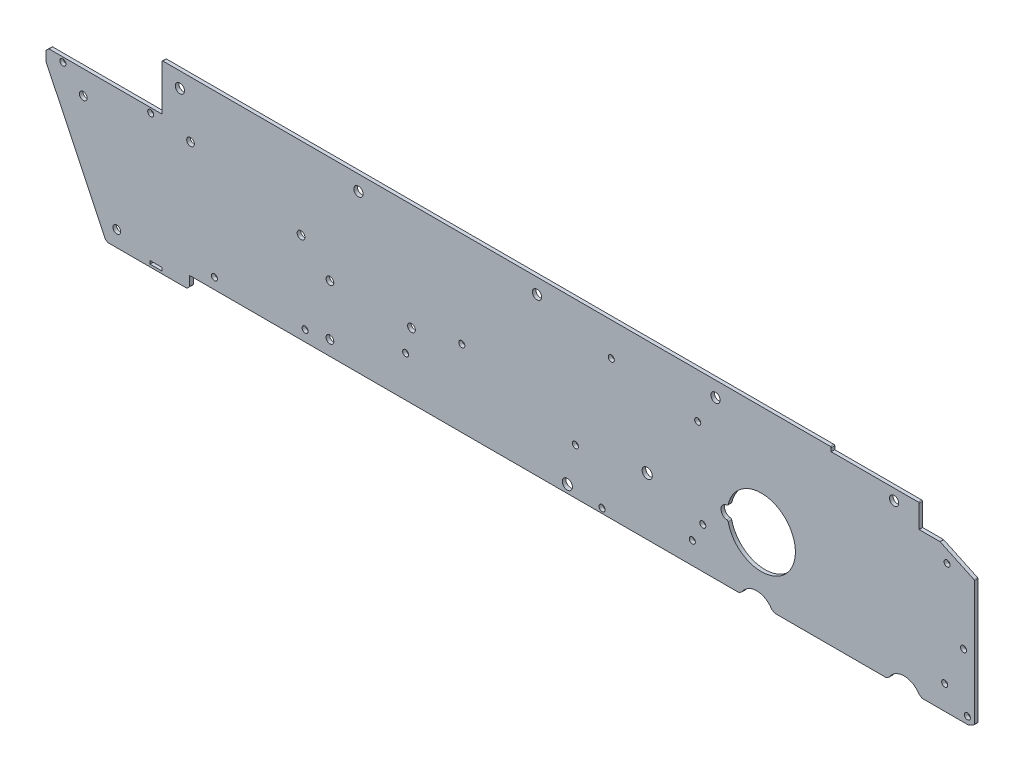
ISO-10303-21;
HEADER;
FILE_DESCRIPTION(('STEP AP214'),'2;1');
FILE_NAME('part.step','',(''),(''),'','','');
FILE_SCHEMA(('AUTOMOTIVE_DESIGN { 1 0 10303 214 1 1 1 1 }'));
ENDSEC;
DATA;
#1=APPLICATION_CONTEXT('core data for automotive mechanical design processes');
#2=APPLICATION_PROTOCOL_DEFINITION('international standard','automotive_design',2000,#1);
#3=PRODUCT_CONTEXT('',#1,'mechanical');
#4=PRODUCT('Part','Part','',(#3));
#5=PRODUCT_RELATED_PRODUCT_CATEGORY('part','',(#4));
#6=PRODUCT_DEFINITION_FORMATION('','',#4);
#7=PRODUCT_DEFINITION_CONTEXT('part definition',#1,'design');
#8=PRODUCT_DEFINITION('design','',#6,#7);
#9=PRODUCT_DEFINITION_SHAPE('','',#8);
#10=(LENGTH_UNIT() NAMED_UNIT(*) SI_UNIT(.MILLI.,.METRE.));
#11=(NAMED_UNIT(*) PLANE_ANGLE_UNIT() SI_UNIT($,.RADIAN.));
#12=(NAMED_UNIT(*) SI_UNIT($,.STERADIAN.) SOLID_ANGLE_UNIT());
#13=UNCERTAINTY_MEASURE_WITH_UNIT(LENGTH_MEASURE(1.E-05),#10,'distance_accuracy_value','');
#14=(GEOMETRIC_REPRESENTATION_CONTEXT(3) GLOBAL_UNCERTAINTY_ASSIGNED_CONTEXT((#13)) GLOBAL_UNIT_ASSIGNED_CONTEXT((#10,
#11,#12)) REPRESENTATION_CONTEXT('',''));
#15=CARTESIAN_POINT('',(0.,0.,0.));
#16=DIRECTION('',(0.,0.,1.));
#17=DIRECTION('',(1.,0.,0.));
#18=AXIS2_PLACEMENT_3D('',#15,#16,#17);
#19=CARTESIAN_POINT('',(251.6124,-18.6944,0.));
#20=DIRECTION('',(0.,0.,-1.));
#21=DIRECTION('',(-1.,0.,0.));
#22=AXIS2_PLACEMENT_3D('',#19,#20,#21);
#23=CYLINDRICAL_SURFACE('',#22,1.69999999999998);
#24=CARTESIAN_POINT('',(251.6124,-18.6944,2.286));
#25=DIRECTION('',(0.,0.,-1.));
#26=DIRECTION('',(-1.,0.,0.));
#27=AXIS2_PLACEMENT_3D('',#24,#25,#26);
#28=CIRCLE('',#27,1.69999999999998);
#29=CARTESIAN_POINT('',(249.9124,-18.6944,2.286));
#30=VERTEX_POINT('',#29);
#31=EDGE_CURVE('E441',#30,#30,#28,.T.);
#32=ORIENTED_EDGE('',*,*,#31,.F.);
#33=EDGE_LOOP('',(#32));
#34=FACE_BOUND('',#33,.T.);
#35=CARTESIAN_POINT('',(251.6124,-18.6944,0.286));
#36=DIRECTION('',(0.,0.,-1.));
#37=DIRECTION('',(-1.,0.,0.));
#38=AXIS2_PLACEMENT_3D('',#35,#36,#37);
#39=CIRCLE('',#38,1.69999999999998);
#40=CARTESIAN_POINT('',(249.9124,-18.6944,0.286));
#41=VERTEX_POINT('',#40);
#42=EDGE_CURVE('E877',#41,#41,#39,.T.);
#43=ORIENTED_EDGE('',*,*,#42,.T.);
#44=EDGE_LOOP('',(#43));
#45=FACE_BOUND('',#44,.T.);
#46=ADVANCED_FACE('F41',(#34,#45),#23,.F.);
#47=CARTESIAN_POINT('',(302.8442,-73.6092,0.286));
#48=DIRECTION('',(0.,0.,-1.));
#49=DIRECTION('',(-1.,0.,0.));
#50=AXIS2_PLACEMENT_3D('',#47,#48,#49);
#51=CYLINDRICAL_SURFACE('',#50,1.69999999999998);
#52=CARTESIAN_POINT('',(302.8442,-73.6092,2.286));
#53=DIRECTION('',(0.,0.,-1.));
#54=DIRECTION('',(-1.,0.,0.));
#55=AXIS2_PLACEMENT_3D('',#52,#53,#54);
#56=CIRCLE('',#55,1.69999999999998);
#57=CARTESIAN_POINT('',(301.1442,-73.6092,2.286));
#58=VERTEX_POINT('',#57);
#59=EDGE_CURVE('E452',#58,#58,#56,.T.);
#60=ORIENTED_EDGE('',*,*,#59,.F.);
#61=EDGE_LOOP('',(#60));
#62=FACE_BOUND('',#61,.T.);
#63=CARTESIAN_POINT('',(302.8442,-73.6092,0.286));
#64=DIRECTION('',(0.,0.,-1.));
#65=DIRECTION('',(-1.,0.,0.));
#66=AXIS2_PLACEMENT_3D('',#63,#64,#65);
#67=CIRCLE('',#66,1.69999999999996);
#68=CARTESIAN_POINT('',(301.1442,-73.6092,0.286));
#69=VERTEX_POINT('',#68);
#70=EDGE_CURVE('E871',#69,#69,#67,.T.);
#71=ORIENTED_EDGE('',*,*,#70,.T.);
#72=EDGE_LOOP('',(#71));
#73=FACE_BOUND('',#72,.T.);
#74=ADVANCED_FACE('F652',(#62,#73),#51,.F.);
#75=CARTESIAN_POINT('',(296.9768,-84.2518,0.286));
#76=DIRECTION('',(0.,0.,-1.));
#77=DIRECTION('',(-1.,0.,0.));
#78=AXIS2_PLACEMENT_3D('',#75,#76,#77);
#79=CYLINDRICAL_SURFACE('',#78,1.69999999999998);
#80=CARTESIAN_POINT('',(296.9768,-84.2518,2.286));
#81=DIRECTION('',(0.,0.,-1.));
#82=DIRECTION('',(-1.,0.,0.));
#83=AXIS2_PLACEMENT_3D('',#80,#81,#82);
#84=CIRCLE('',#83,1.69999999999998);
#85=CARTESIAN_POINT('',(295.2768,-84.2518,2.286));
#86=VERTEX_POINT('',#85);
#87=EDGE_CURVE('E557',#86,#86,#84,.T.);
#88=ORIENTED_EDGE('',*,*,#87,.F.);
#89=EDGE_LOOP('',(#88));
#90=FACE_BOUND('',#89,.T.);
#91=CARTESIAN_POINT('',(296.9768,-84.2518,0.286));
#92=DIRECTION('',(0.,0.,-1.));
#93=DIRECTION('',(-1.,0.,0.));
#94=AXIS2_PLACEMENT_3D('',#91,#92,#93);
#95=CIRCLE('',#94,1.69999999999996);
#96=CARTESIAN_POINT('',(295.2768,-84.2518,0.286));
#97=VERTEX_POINT('',#96);
#98=EDGE_CURVE('E874',#97,#97,#95,.T.);
#99=ORIENTED_EDGE('',*,*,#98,.T.);
#100=EDGE_LOOP('',(#99));
#101=FACE_BOUND('',#100,.T.);
#102=ADVANCED_FACE('F657',(#90,#101),#79,.F.);
#103=CARTESIAN_POINT('',(300.0248,-25.0444,0.286));
#104=DIRECTION('',(0.,0.,-1.));
#105=DIRECTION('',(-1.,0.,0.));
#106=AXIS2_PLACEMENT_3D('',#103,#104,#105);
#107=CYLINDRICAL_SURFACE('',#106,1.69999999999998);
#108=CARTESIAN_POINT('',(300.0248,-25.0444,2.286));
#109=DIRECTION('',(0.,0.,-1.));
#110=DIRECTION('',(-1.,0.,0.));
#111=AXIS2_PLACEMENT_3D('',#108,#109,#110);
#112=CIRCLE('',#111,1.69999999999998);
#113=CARTESIAN_POINT('',(298.3248,-25.0444,2.286));
#114=VERTEX_POINT('',#113);
#115=EDGE_CURVE('E560',#114,#114,#112,.T.);
#116=ORIENTED_EDGE('',*,*,#115,.F.);
#117=EDGE_LOOP('',(#116));
#118=FACE_BOUND('',#117,.T.);
#119=CARTESIAN_POINT('',(300.0248,-25.0444,0.286));
#120=DIRECTION('',(0.,0.,-1.));
#121=DIRECTION('',(-1.,0.,0.));
#122=AXIS2_PLACEMENT_3D('',#119,#120,#121);
#123=CIRCLE('',#122,1.69999999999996);
#124=CARTESIAN_POINT('',(298.3248,-25.0444,0.286));
#125=VERTEX_POINT('',#124);
#126=EDGE_CURVE('E866',#125,#125,#123,.T.);
#127=ORIENTED_EDGE('',*,*,#126,.T.);
#128=EDGE_LOOP('',(#127));
#129=FACE_BOUND('',#128,.T.);
#130=ADVANCED_FACE('F1736',(#118,#129),#107,.F.);
#131=CARTESIAN_POINT('',(439.674,-24.0792,0.286));
#132=DIRECTION('',(0.,0.,-1.));
#133=DIRECTION('',(-1.,0.,0.));
#134=AXIS2_PLACEMENT_3D('',#131,#132,#133);
#135=CYLINDRICAL_SURFACE('',#134,1.69999999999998);
#136=CARTESIAN_POINT('',(439.674,-24.0792,2.286));
#137=DIRECTION('',(0.,0.,-1.));
#138=DIRECTION('',(-1.,0.,0.));
#139=AXIS2_PLACEMENT_3D('',#136,#137,#138);
#140=CIRCLE('',#139,1.69999999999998);
#141=CARTESIAN_POINT('',(437.974,-24.0792,2.286));
#142=VERTEX_POINT('',#141);
#143=EDGE_CURVE('E563',#142,#142,#140,.T.);
#144=ORIENTED_EDGE('',*,*,#143,.F.);
#145=EDGE_LOOP('',(#144));
#146=FACE_BOUND('',#145,.T.);
#147=CARTESIAN_POINT('',(439.674,-24.0792,0.286));
#148=DIRECTION('',(0.,0.,-1.));
#149=DIRECTION('',(-1.,0.,0.));
#150=AXIS2_PLACEMENT_3D('',#147,#148,#149);
#151=CIRCLE('',#150,1.69999999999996);
#152=CARTESIAN_POINT('',(437.974,-24.0792,0.286));
#153=VERTEX_POINT('',#152);
#154=EDGE_CURVE('E855',#153,#153,#151,.T.);
#155=ORIENTED_EDGE('',*,*,#154,.T.);
#156=EDGE_LOOP('',(#155));
#157=FACE_BOUND('',#156,.T.);
#158=ADVANCED_FACE('F1747',(#146,#157),#135,.F.);
#159=CARTESIAN_POINT('',(448.8942,-60.9599999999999,0.286));
#160=DIRECTION('',(0.,0.,-1.));
#161=DIRECTION('',(-1.,0.,0.));
#162=AXIS2_PLACEMENT_3D('',#159,#160,#161);
#163=CYLINDRICAL_SURFACE('',#162,1.69999999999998);
#164=CARTESIAN_POINT('',(448.8942,-60.9599999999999,2.286));
#165=DIRECTION('',(0.,0.,-1.));
#166=DIRECTION('',(-1.,0.,0.));
#167=AXIS2_PLACEMENT_3D('',#164,#165,#166);
#168=CIRCLE('',#167,1.69999999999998);
#169=CARTESIAN_POINT('',(447.1942,-60.9599999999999,2.286));
#170=VERTEX_POINT('',#169);
#171=EDGE_CURVE('E566',#170,#170,#168,.T.);
#172=ORIENTED_EDGE('',*,*,#171,.F.);
#173=EDGE_LOOP('',(#172));
#174=FACE_BOUND('',#173,.T.);
#175=CARTESIAN_POINT('',(448.8942,-60.9599999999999,0.286));
#176=DIRECTION('',(0.,0.,-1.));
#177=DIRECTION('',(-1.,0.,0.));
#178=AXIS2_PLACEMENT_3D('',#175,#176,#177);
#179=CIRCLE('',#178,1.69999999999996);
#180=CARTESIAN_POINT('',(447.1942,-60.9599999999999,0.286));
#181=VERTEX_POINT('',#180);
#182=EDGE_CURVE('E860',#181,#181,#179,.T.);
#183=ORIENTED_EDGE('',*,*,#182,.T.);
#184=EDGE_LOOP('',(#183));
#185=FACE_BOUND('',#184,.T.);
#186=ADVANCED_FACE('F1758',(#174,#185),#163,.F.);
#187=CARTESIAN_POINT('',(451.0278,-92.5575999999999,0.286));
#188=DIRECTION('',(0.,0.,-1.));
#189=DIRECTION('',(-1.,0.,0.));
#190=AXIS2_PLACEMENT_3D('',#187,#188,#189);
#191=CYLINDRICAL_SURFACE('',#190,1.69999999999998);
#192=CARTESIAN_POINT('',(451.0278,-92.5575999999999,2.286));
#193=DIRECTION('',(0.,0.,-1.));
#194=DIRECTION('',(-1.,0.,0.));
#195=AXIS2_PLACEMENT_3D('',#192,#193,#194);
#196=CIRCLE('',#195,1.69999999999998);
#197=CARTESIAN_POINT('',(449.3278,-92.5575999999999,2.286));
#198=VERTEX_POINT('',#197);
#199=EDGE_CURVE('E569',#198,#198,#196,.T.);
#200=ORIENTED_EDGE('',*,*,#199,.F.);
#201=EDGE_LOOP('',(#200));
#202=FACE_BOUND('',#201,.T.);
#203=CARTESIAN_POINT('',(451.0278,-92.5575999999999,0.286));
#204=DIRECTION('',(0.,0.,-1.));
#205=DIRECTION('',(-1.,0.,0.));
#206=AXIS2_PLACEMENT_3D('',#203,#204,#205);
#207=CIRCLE('',#206,1.69999999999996);
#208=CARTESIAN_POINT('',(449.3278,-92.5575999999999,0.286));
#209=VERTEX_POINT('',#208);
#210=EDGE_CURVE('E2174',#209,#209,#207,.T.);
#211=ORIENTED_EDGE('',*,*,#210,.T.);
#212=EDGE_LOOP('',(#211));
#213=FACE_BOUND('',#212,.T.);
#214=ADVANCED_FACE('F1769',(#202,#213),#191,.F.);
#215=CARTESIAN_POINT('',(438.3278,-83.0071999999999,0.286));
#216=DIRECTION('',(0.,0.,-1.));
#217=DIRECTION('',(-1.,0.,0.));
#218=AXIS2_PLACEMENT_3D('',#215,#216,#217);
#219=CYLINDRICAL_SURFACE('',#218,1.69999999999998);
#220=CARTESIAN_POINT('',(438.3278,-83.0071999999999,2.286));
#221=DIRECTION('',(0.,0.,-1.));
#222=DIRECTION('',(-1.,0.,0.));
#223=AXIS2_PLACEMENT_3D('',#220,#221,#222);
#224=CIRCLE('',#223,1.69999999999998);
#225=CARTESIAN_POINT('',(436.6278,-83.0071999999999,2.286));
#226=VERTEX_POINT('',#225);
#227=EDGE_CURVE('E572',#226,#226,#224,.T.);
#228=ORIENTED_EDGE('',*,*,#227,.F.);
#229=EDGE_LOOP('',(#228));
#230=FACE_BOUND('',#229,.T.);
#231=CARTESIAN_POINT('',(438.3278,-83.0071999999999,0.286));
#232=DIRECTION('',(0.,0.,-1.));
#233=DIRECTION('',(-1.,0.,0.));
#234=AXIS2_PLACEMENT_3D('',#231,#232,#233);
#235=CIRCLE('',#234,1.69999999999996);
#236=CARTESIAN_POINT('',(436.6278,-83.0071999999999,0.286));
#237=VERTEX_POINT('',#236);
#238=EDGE_CURVE('E2170',#237,#237,#235,.T.);
#239=ORIENTED_EDGE('',*,*,#238,.T.);
#240=EDGE_LOOP('',(#239));
#241=FACE_BOUND('',#240,.T.);
#242=ADVANCED_FACE('F1780',(#230,#241),#219,.F.);
#243=CARTESIAN_POINT('',(231.521,-70.6882,0.286));
#244=DIRECTION('',(0.,0.,-1.));
#245=DIRECTION('',(-1.,0.,0.));
#246=AXIS2_PLACEMENT_3D('',#243,#244,#245);
#247=CYLINDRICAL_SURFACE('',#246,1.70000000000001);
#248=CARTESIAN_POINT('',(231.521,-70.6882,2.286));
#249=DIRECTION('',(0.,0.,-1.));
#250=DIRECTION('',(-1.,0.,0.));
#251=AXIS2_PLACEMENT_3D('',#248,#249,#250);
#252=CIRCLE('',#251,1.70000000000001);
#253=CARTESIAN_POINT('',(229.821,-70.6882,2.286));
#254=VERTEX_POINT('',#253);
#255=EDGE_CURVE('E575',#254,#254,#252,.T.);
#256=ORIENTED_EDGE('',*,*,#255,.F.);
#257=EDGE_LOOP('',(#256));
#258=FACE_BOUND('',#257,.T.);
#259=CARTESIAN_POINT('',(231.521,-70.6882,0.286));
#260=DIRECTION('',(0.,0.,-1.));
#261=DIRECTION('',(-1.,0.,0.));
#262=AXIS2_PLACEMENT_3D('',#259,#260,#261);
#263=CIRCLE('',#262,1.70000000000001);
#264=CARTESIAN_POINT('',(229.821,-70.6882,0.286));
#265=VERTEX_POINT('',#264);
#266=EDGE_CURVE('E880',#265,#265,#263,.T.);
#267=ORIENTED_EDGE('',*,*,#266,.T.);
#268=EDGE_LOOP('',(#267));
#269=FACE_BOUND('',#268,.T.);
#270=ADVANCED_FACE('F1791',(#258,#269),#247,.F.);
#271=CARTESIAN_POINT('',(246.4562,-93.853,0.286));
#272=DIRECTION('',(0.,0.,-1.));
#273=DIRECTION('',(-1.,0.,0.));
#274=AXIS2_PLACEMENT_3D('',#271,#272,#273);
#275=CYLINDRICAL_SURFACE('',#274,1.70000000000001);
#276=CARTESIAN_POINT('',(246.4562,-93.853,2.286));
#277=DIRECTION('',(0.,0.,-1.));
#278=DIRECTION('',(-1.,0.,0.));
#279=AXIS2_PLACEMENT_3D('',#276,#277,#278);
#280=CIRCLE('',#279,1.70000000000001);
#281=CARTESIAN_POINT('',(244.7562,-93.853,2.286));
#282=VERTEX_POINT('',#281);
#283=EDGE_CURVE('E445',#282,#282,#280,.T.);
#284=ORIENTED_EDGE('',*,*,#283,.F.);
#285=EDGE_LOOP('',(#284));
#286=FACE_BOUND('',#285,.T.);
#287=CARTESIAN_POINT('',(246.4562,-93.853,0.286));
#288=DIRECTION('',(0.,0.,-1.));
#289=DIRECTION('',(-1.,0.,0.));
#290=AXIS2_PLACEMENT_3D('',#287,#288,#289);
#291=CIRCLE('',#290,1.70000000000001);
#292=CARTESIAN_POINT('',(244.7562,-93.853,0.286));
#293=VERTEX_POINT('',#292);
#294=EDGE_CURVE('E927',#293,#293,#291,.T.);
#295=ORIENTED_EDGE('',*,*,#294,.T.);
#296=EDGE_LOOP('',(#295));
#297=FACE_BOUND('',#296,.T.);
#298=ADVANCED_FACE('F806',(#286,#297),#275,.F.);
#299=CARTESIAN_POINT('',(167.8686,-53.6194,0.286));
#300=DIRECTION('',(0.,0.,-1.));
#301=DIRECTION('',(-1.,0.,0.));
#302=AXIS2_PLACEMENT_3D('',#299,#300,#301);
#303=CYLINDRICAL_SURFACE('',#302,1.70000000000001);
#304=CARTESIAN_POINT('',(167.8686,-53.6194,2.286));
#305=DIRECTION('',(0.,0.,-1.));
#306=DIRECTION('',(-1.,0.,0.));
#307=AXIS2_PLACEMENT_3D('',#304,#305,#306);
#308=CIRCLE('',#307,1.70000000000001);
#309=CARTESIAN_POINT('',(166.1686,-53.6194,2.286));
#310=VERTEX_POINT('',#309);
#311=EDGE_CURVE('E517',#310,#310,#308,.T.);
#312=ORIENTED_EDGE('',*,*,#311,.F.);
#313=EDGE_LOOP('',(#312));
#314=FACE_BOUND('',#313,.T.);
#315=CARTESIAN_POINT('',(167.8686,-53.6194,0.286));
#316=DIRECTION('',(0.,0.,-1.));
#317=DIRECTION('',(-1.,0.,0.));
#318=AXIS2_PLACEMENT_3D('',#315,#316,#317);
#319=CIRCLE('',#318,1.70000000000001);
#320=CARTESIAN_POINT('',(166.1686,-53.6194,0.286));
#321=VERTEX_POINT('',#320);
#322=EDGE_CURVE('E887',#321,#321,#319,.T.);
#323=ORIENTED_EDGE('',*,*,#322,.T.);
#324=EDGE_LOOP('',(#323));
#325=FACE_BOUND('',#324,.T.);
#326=ADVANCED_FACE('F802',(#314,#325),#303,.F.);
#327=CARTESIAN_POINT('',(136.4488,-73.7108,0.286));
#328=DIRECTION('',(0.,0.,-1.));
#329=DIRECTION('',(-1.,0.,0.));
#330=AXIS2_PLACEMENT_3D('',#327,#328,#329);
#331=CYLINDRICAL_SURFACE('',#330,1.70000000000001);
#332=CARTESIAN_POINT('',(136.4488,-73.7108,2.286));
#333=DIRECTION('',(0.,0.,-1.));
#334=DIRECTION('',(-1.,0.,0.));
#335=AXIS2_PLACEMENT_3D('',#332,#333,#334);
#336=CIRCLE('',#335,1.70000000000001);
#337=CARTESIAN_POINT('',(134.7488,-73.7108,2.286));
#338=VERTEX_POINT('',#337);
#339=EDGE_CURVE('E943',#338,#338,#336,.T.);
#340=ORIENTED_EDGE('',*,*,#339,.F.);
#341=EDGE_LOOP('',(#340));
#342=FACE_BOUND('',#341,.T.);
#343=CARTESIAN_POINT('',(136.4488,-73.7108,0.286));
#344=DIRECTION('',(0.,0.,-1.));
#345=DIRECTION('',(-1.,0.,0.));
#346=AXIS2_PLACEMENT_3D('',#343,#344,#345);
#347=CIRCLE('',#346,1.70000000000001);
#348=CARTESIAN_POINT('',(134.7488,-73.7108,0.286));
#349=VERTEX_POINT('',#348);
#350=EDGE_CURVE('E901',#349,#349,#347,.T.);
#351=ORIENTED_EDGE('',*,*,#350,.T.);
#352=EDGE_LOOP('',(#351));
#353=FACE_BOUND('',#352,.T.);
#354=ADVANCED_FACE('F805',(#342,#353),#331,.F.);
#355=CARTESIAN_POINT('',(80.137,-90.424,0.286));
#356=DIRECTION('',(0.,0.,-1.));
#357=DIRECTION('',(-1.,0.,0.));
#358=AXIS2_PLACEMENT_3D('',#355,#356,#357);
#359=CYLINDRICAL_SURFACE('',#358,1.69999999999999);
#360=CARTESIAN_POINT('',(80.137,-90.424,2.286));
#361=DIRECTION('',(0.,0.,-1.));
#362=DIRECTION('',(-1.,0.,0.));
#363=AXIS2_PLACEMENT_3D('',#360,#361,#362);
#364=CIRCLE('',#363,1.69999999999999);
#365=CARTESIAN_POINT('',(78.437,-90.424,2.286));
#366=VERTEX_POINT('',#365);
#367=EDGE_CURVE('E940',#366,#366,#364,.T.);
#368=ORIENTED_EDGE('',*,*,#367,.F.);
#369=EDGE_LOOP('',(#368));
#370=FACE_BOUND('',#369,.T.);
#371=CARTESIAN_POINT('',(80.137,-90.424,0.286));
#372=DIRECTION('',(0.,0.,-1.));
#373=DIRECTION('',(-1.,0.,0.));
#374=AXIS2_PLACEMENT_3D('',#371,#372,#373);
#375=CIRCLE('',#374,1.7);
#376=CARTESIAN_POINT('',(78.437,-90.424,0.286));
#377=VERTEX_POINT('',#376);
#378=EDGE_CURVE('E907',#377,#377,#375,.T.);
#379=ORIENTED_EDGE('',*,*,#378,.T.);
#380=EDGE_LOOP('',(#379));
#381=FACE_BOUND('',#380,.T.);
#382=ADVANCED_FACE('F810',(#370,#381),#359,.F.);
#383=CARTESIAN_POINT('',(-6.34999999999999,-28.6766,0.286));
#384=DIRECTION('',(0.,0.,-1.));
#385=DIRECTION('',(-1.,0.,0.));
#386=AXIS2_PLACEMENT_3D('',#383,#384,#385);
#387=CYLINDRICAL_SURFACE('',#386,1.7);
#388=CARTESIAN_POINT('',(-6.34999999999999,-28.6766,2.286));
#389=DIRECTION('',(0.,0.,-1.));
#390=DIRECTION('',(-1.,0.,0.));
#391=AXIS2_PLACEMENT_3D('',#388,#389,#390);
#392=CIRCLE('',#391,1.7);
#393=CARTESIAN_POINT('',(-8.05,-28.6766,2.286));
#394=VERTEX_POINT('',#393);
#395=EDGE_CURVE('E937',#394,#394,#392,.T.);
#396=ORIENTED_EDGE('',*,*,#395,.F.);
#397=EDGE_LOOP('',(#396));
#398=FACE_BOUND('',#397,.T.);
#399=CARTESIAN_POINT('',(-6.34999999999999,-28.6766,0.286));
#400=DIRECTION('',(0.,0.,-1.));
#401=DIRECTION('',(-1.,0.,0.));
#402=AXIS2_PLACEMENT_3D('',#399,#400,#401);
#403=CIRCLE('',#402,1.7);
#404=CARTESIAN_POINT('',(-8.05,-28.6766,0.286));
#405=VERTEX_POINT('',#404);
#406=EDGE_CURVE('E922',#405,#405,#403,.T.);
#407=ORIENTED_EDGE('',*,*,#406,.T.);
#408=EDGE_LOOP('',(#407));
#409=FACE_BOUND('',#408,.T.);
#410=ADVANCED_FACE('F666',(#398,#409),#387,.F.);
#411=CARTESIAN_POINT('',(335.661,-61.0362,0.));
#412=DIRECTION('',(0.,0.,1.));
#413=DIRECTION('',(1.,0.,0.));
#414=AXIS2_PLACEMENT_3D('',#411,#412,#413);
#415=CYLINDRICAL_SURFACE('',#414,19.05);
#416=CARTESIAN_POINT('',(335.661,-61.0362,0.286));
#417=DIRECTION('',(0.,0.,-1.));
#418=DIRECTION('',(-1.,0.,0.));
#419=AXIS2_PLACEMENT_3D('',#416,#417,#418);
#420=CIRCLE('',#419,19.05);
#421=CARTESIAN_POINT('',(317.103696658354,-65.3407316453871,0.286));
#422=VERTEX_POINT('',#421);
#423=CARTESIAN_POINT('',(317.103696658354,-56.731668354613,0.286));
#424=VERTEX_POINT('',#423);
#425=EDGE_CURVE('E476',#422,#424,#420,.F.);
#426=ORIENTED_EDGE('',*,*,#425,.F.);
#427=DIRECTION('',(0.,0.,1.));
#428=VECTOR('',#427,1.);
#429=CARTESIAN_POINT('',(317.103696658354,-65.3407316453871,0.));
#430=LINE('',#429,#428);
#431=CARTESIAN_POINT('',(317.103696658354,-65.3407316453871,2.286));
#432=VERTEX_POINT('',#431);
#433=EDGE_CURVE('E1288',#422,#432,#430,.T.);
#434=ORIENTED_EDGE('',*,*,#433,.T.);
#435=CARTESIAN_POINT('',(335.661,-61.0362,2.286));
#436=DIRECTION('',(0.,0.,1.));
#437=DIRECTION('',(1.,0.,0.));
#438=AXIS2_PLACEMENT_3D('',#435,#436,#437);
#439=CIRCLE('',#438,19.05);
#440=CARTESIAN_POINT('',(317.103696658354,-56.731668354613,2.286));
#441=VERTEX_POINT('',#440);
#442=EDGE_CURVE('E442',#432,#441,#439,.T.);
#443=ORIENTED_EDGE('',*,*,#442,.T.);
#444=DIRECTION('',(0.,0.,1.));
#445=VECTOR('',#444,1.);
#446=CARTESIAN_POINT('',(317.103696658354,-56.731668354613,0.));
#447=LINE('',#446,#445);
#448=EDGE_CURVE('E479',#441,#424,#447,.F.);
#449=ORIENTED_EDGE('',*,*,#448,.T.);
#450=EDGE_LOOP('',(#426,#434,#443,#449));
#451=FACE_BOUND('',#450,.T.);
#452=ADVANCED_FACE('F662',(#451),#415,.F.);
#453=CARTESIAN_POINT('',(316.611,-61.0362,0.));
#454=DIRECTION('',(0.,0.,1.));
#455=DIRECTION('',(1.,0.,0.));
#456=AXIS2_PLACEMENT_3D('',#453,#454,#455);
#457=CYLINDRICAL_SURFACE('',#456,3.55599999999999);
#458=CARTESIAN_POINT('',(316.611,-61.0362,2.286));
#459=DIRECTION('',(0.,0.,1.));
#460=DIRECTION('',(1.,0.,0.));
#461=AXIS2_PLACEMENT_3D('',#458,#459,#460);
#462=CIRCLE('',#461,3.55599999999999);
#463=CARTESIAN_POINT('',(316.235231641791,-57.5001097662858,2.286));
#464=VERTEX_POINT('',#463);
#465=CARTESIAN_POINT('',(316.235231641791,-64.5722902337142,2.286));
#466=VERTEX_POINT('',#465);
#467=EDGE_CURVE('E446',#464,#466,#462,.T.);
#468=ORIENTED_EDGE('',*,*,#467,.T.);
#469=DIRECTION('',(0.,0.,1.));
#470=VECTOR('',#469,1.);
#471=CARTESIAN_POINT('',(316.235231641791,-64.5722902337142,0.));
#472=LINE('',#471,#470);
#473=CARTESIAN_POINT('',(316.235231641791,-64.5722902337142,0.286));
#474=VERTEX_POINT('',#473);
#475=EDGE_CURVE('E1280',#466,#474,#472,.F.);
#476=ORIENTED_EDGE('',*,*,#475,.T.);
#477=CARTESIAN_POINT('',(316.611,-61.0362,0.286));
#478=DIRECTION('',(0.,0.,-1.));
#479=DIRECTION('',(-1.,0.,0.));
#480=AXIS2_PLACEMENT_3D('',#477,#478,#479);
#481=CIRCLE('',#480,3.55599999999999);
#482=CARTESIAN_POINT('',(316.235231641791,-57.5001097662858,0.286));
#483=VERTEX_POINT('',#482);
#484=EDGE_CURVE('E406',#483,#474,#481,.F.);
#485=ORIENTED_EDGE('',*,*,#484,.F.);
#486=DIRECTION('',(0.,0.,1.));
#487=VECTOR('',#486,1.);
#488=CARTESIAN_POINT('',(316.235231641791,-57.5001097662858,0.));
#489=LINE('',#488,#487);
#490=EDGE_CURVE('E1282',#483,#464,#489,.T.);
#491=ORIENTED_EDGE('',*,*,#490,.T.);
#492=EDGE_LOOP('',(#468,#476,#485,#491));
#493=FACE_BOUND('',#492,.T.);
#494=ADVANCED_FACE('F665',(#493),#457,.F.);
#495=CARTESIAN_POINT('',(-0.126999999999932,-100.3554,2.286));
#496=DIRECTION('',(0.,-1.,0.));
#497=DIRECTION('',(0.,0.,-1.));
#498=AXIS2_PLACEMENT_3D('',#495,#496,#497);
#499=PLANE('',#498);
#500=DIRECTION('',(0.,0.,-1.));
#501=VECTOR('',#500,1.);
#502=CARTESIAN_POINT('',(-6.73099999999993,-100.3554,2.286));
#503=LINE('',#502,#501);
#504=CARTESIAN_POINT('',(-6.73099999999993,-100.3554,2.286));
#505=VERTEX_POINT('',#504);
#506=CARTESIAN_POINT('',(-6.73099999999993,-100.3554,0.286));
#507=VERTEX_POINT('',#506);
#508=EDGE_CURVE('E416',#505,#507,#503,.T.);
#509=ORIENTED_EDGE('',*,*,#508,.T.);
#510=DIRECTION('',(1.,0.,0.));
#511=VECTOR('',#510,1.);
#512=CARTESIAN_POINT('',(-0.126999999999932,-100.3554,0.286));
#513=LINE('',#512,#511);
#514=CARTESIAN_POINT('',(-0.126999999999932,-100.3554,0.286));
#515=VERTEX_POINT('',#514);
#516=EDGE_CURVE('E398',#507,#515,#513,.T.);
#517=ORIENTED_EDGE('',*,*,#516,.T.);
#518=DIRECTION('',(0.,0.,-1.));
#519=VECTOR('',#518,1.);
#520=CARTESIAN_POINT('',(-0.126999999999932,-100.3554,2.286));
#521=LINE('',#520,#519);
#522=CARTESIAN_POINT('',(-0.126999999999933,-100.3554,2.286));
#523=VERTEX_POINT('',#522);
#524=EDGE_CURVE('E413',#523,#515,#521,.T.);
#525=ORIENTED_EDGE('',*,*,#524,.F.);
#526=DIRECTION('',(-1.,0.,0.));
#527=VECTOR('',#526,1.);
#528=CARTESIAN_POINT('',(-0.126999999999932,-100.3554,2.286));
#529=LINE('',#528,#527);
#530=EDGE_CURVE('E417',#523,#505,#529,.T.);
#531=ORIENTED_EDGE('',*,*,#530,.T.);
#532=EDGE_LOOP('',(#509,#517,#525,#531));
#533=FACE_BOUND('',#532,.T.);
#534=ADVANCED_FACE('F412',(#533),#499,.T.);
#535=CARTESIAN_POINT('',(-0.126999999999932,-100.3554,2.286));
#536=DIRECTION('',(1.,0.,0.));
#537=DIRECTION('',(0.,1.,0.));
#538=AXIS2_PLACEMENT_3D('',#535,#536,#537);
#539=PLANE('',#538);
#540=DIRECTION('',(0.,1.,0.));
#541=VECTOR('',#540,1.);
#542=CARTESIAN_POINT('',(-0.126999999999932,-100.3554,0.286));
#543=LINE('',#542,#541);
#544=CARTESIAN_POINT('',(-0.126999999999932,-102.1334,0.286));
#545=VERTEX_POINT('',#544);
#546=EDGE_CURVE('E394',#545,#515,#543,.T.);
#547=ORIENTED_EDGE('',*,*,#546,.F.);
#548=DIRECTION('',(0.,0.,-1.));
#549=VECTOR('',#548,1.);
#550=CARTESIAN_POINT('',(-0.126999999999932,-102.1334,2.286));
#551=LINE('',#550,#549);
#552=CARTESIAN_POINT('',(-0.126999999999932,-102.1334,2.286));
#553=VERTEX_POINT('',#552);
#554=EDGE_CURVE('E428',#553,#545,#551,.T.);
#555=ORIENTED_EDGE('',*,*,#554,.F.);
#556=DIRECTION('',(0.,-1.,0.));
#557=VECTOR('',#556,1.);
#558=CARTESIAN_POINT('',(-0.126999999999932,-100.3554,2.286));
#559=LINE('',#558,#557);
#560=EDGE_CURVE('E421',#523,#553,#559,.T.);
#561=ORIENTED_EDGE('',*,*,#560,.F.);
#562=ORIENTED_EDGE('',*,*,#524,.T.);
#563=EDGE_LOOP('',(#547,#555,#561,#562));
#564=FACE_BOUND('',#563,.T.);
#565=ADVANCED_FACE('F419',(#564),#539,.F.);
#566=CARTESIAN_POINT('',(-6.73099999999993,-102.1334,2.286));
#567=DIRECTION('',(0.,1.,0.));
#568=DIRECTION('',(0.,0.,1.));
#569=AXIS2_PLACEMENT_3D('',#566,#567,#568);
#570=PLANE('',#569);
#571=ORIENTED_EDGE('',*,*,#554,.T.);
#572=DIRECTION('',(-1.,0.,0.));
#573=VECTOR('',#572,1.);
#574=CARTESIAN_POINT('',(-6.73099999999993,-102.1334,0.286));
#575=LINE('',#574,#573);
#576=CARTESIAN_POINT('',(-6.73099999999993,-102.1334,0.286));
#577=VERTEX_POINT('',#576);
#578=EDGE_CURVE('E401',#545,#577,#575,.T.);
#579=ORIENTED_EDGE('',*,*,#578,.T.);
#580=DIRECTION('',(0.,0.,-1.));
#581=VECTOR('',#580,1.);
#582=CARTESIAN_POINT('',(-6.73099999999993,-102.1334,2.286));
#583=LINE('',#582,#581);
#584=CARTESIAN_POINT('',(-6.73099999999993,-102.1334,2.286));
#585=VERTEX_POINT('',#584);
#586=EDGE_CURVE('E430',#585,#577,#583,.T.);
#587=ORIENTED_EDGE('',*,*,#586,.F.);
#588=DIRECTION('',(1.,0.,0.));
#589=VECTOR('',#588,1.);
#590=CARTESIAN_POINT('',(-6.73099999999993,-102.1334,2.286));
#591=LINE('',#590,#589);
#592=EDGE_CURVE('E422',#585,#553,#591,.T.);
#593=ORIENTED_EDGE('',*,*,#592,.T.);
#594=EDGE_LOOP('',(#571,#579,#587,#593));
#595=FACE_BOUND('',#594,.T.);
#596=ADVANCED_FACE('F671',(#595),#570,.T.);
#597=CARTESIAN_POINT('',(-6.73099999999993,-102.1334,2.286));
#598=DIRECTION('',(-1.,0.,0.));
#599=DIRECTION('',(0.,0.,1.));
#600=AXIS2_PLACEMENT_3D('',#597,#598,#599);
#601=PLANE('',#600);
#602=DIRECTION('',(0.,-1.,0.));
#603=VECTOR('',#602,1.);
#604=CARTESIAN_POINT('',(-6.73099999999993,-102.1334,0.286));
#605=LINE('',#604,#603);
#606=EDGE_CURVE('E407',#507,#577,#605,.T.);
#607=ORIENTED_EDGE('',*,*,#606,.F.);
#608=ORIENTED_EDGE('',*,*,#508,.F.);
#609=DIRECTION('',(0.,1.,0.));
#610=VECTOR('',#609,1.);
#611=CARTESIAN_POINT('',(-6.73099999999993,-102.1334,2.286));
#612=LINE('',#611,#610);
#613=EDGE_CURVE('E436',#585,#505,#612,.T.);
#614=ORIENTED_EDGE('',*,*,#613,.F.);
#615=ORIENTED_EDGE('',*,*,#586,.T.);
#616=EDGE_LOOP('',(#607,#608,#614,#615));
#617=FACE_BOUND('',#616,.T.);
#618=ADVANCED_FACE('F629',(#617),#601,.F.);
#619=CARTESIAN_POINT('',(226.99472,-92.00896,0.));
#620=DIRECTION('',(0.,0.,-1.));
#621=DIRECTION('',(-1.,0.,0.));
#622=AXIS2_PLACEMENT_3D('',#619,#620,#621);
#623=CYLINDRICAL_SURFACE('',#622,2.85000000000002);
#624=CARTESIAN_POINT('',(226.99472,-92.00896,2.286));
#625=DIRECTION('',(0.,0.,-1.));
#626=DIRECTION('',(-1.,0.,0.));
#627=AXIS2_PLACEMENT_3D('',#624,#625,#626);
#628=CIRCLE('',#627,2.85000000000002);
#629=CARTESIAN_POINT('',(224.14472,-92.00896,2.286));
#630=VERTEX_POINT('',#629);
#631=EDGE_CURVE('E435',#630,#630,#628,.T.);
#632=ORIENTED_EDGE('',*,*,#631,.F.);
#633=EDGE_LOOP('',(#632));
#634=FACE_BOUND('',#633,.T.);
#635=CARTESIAN_POINT('',(226.99472,-92.00896,0.286));
#636=DIRECTION('',(0.,0.,-1.));
#637=DIRECTION('',(-1.,0.,0.));
#638=AXIS2_PLACEMENT_3D('',#635,#636,#637);
#639=CIRCLE('',#638,2.85000000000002);
#640=CARTESIAN_POINT('',(224.14472,-92.00896,0.286));
#641=VERTEX_POINT('',#640);
#642=EDGE_CURVE('E432',#641,#641,#639,.T.);
#643=ORIENTED_EDGE('',*,*,#642,.T.);
#644=EDGE_LOOP('',(#643));
#645=FACE_BOUND('',#644,.T.);
#646=ADVANCED_FACE('F625',(#634,#645),#623,.F.);
#647=CARTESIAN_POINT('',(271.71396,-64.2696200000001,0.));
#648=DIRECTION('',(0.,0.,-1.));
#649=DIRECTION('',(-1.,0.,0.));
#650=AXIS2_PLACEMENT_3D('',#647,#648,#649);
#651=CYLINDRICAL_SURFACE('',#650,2.85000000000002);
#652=CARTESIAN_POINT('',(271.71396,-64.2696200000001,2.286));
#653=DIRECTION('',(0.,0.,-1.));
#654=DIRECTION('',(-1.,0.,0.));
#655=AXIS2_PLACEMENT_3D('',#652,#653,#654);
#656=CIRCLE('',#655,2.85000000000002);
#657=CARTESIAN_POINT('',(268.86396,-64.2696200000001,2.286));
#658=VERTEX_POINT('',#657);
#659=EDGE_CURVE('E615',#658,#658,#656,.T.);
#660=ORIENTED_EDGE('',*,*,#659,.F.);
#661=EDGE_LOOP('',(#660));
#662=FACE_BOUND('',#661,.T.);
#663=CARTESIAN_POINT('',(271.71396,-64.2696200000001,0.286));
#664=DIRECTION('',(0.,0.,-1.));
#665=DIRECTION('',(-1.,0.,0.));
#666=AXIS2_PLACEMENT_3D('',#663,#664,#665);
#667=CIRCLE('',#666,2.85000000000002);
#668=CARTESIAN_POINT('',(268.86396,-64.2696200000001,0.286));
#669=VERTEX_POINT('',#668);
#670=EDGE_CURVE('E466',#669,#669,#667,.T.);
#671=ORIENTED_EDGE('',*,*,#670,.T.);
#672=EDGE_LOOP('',(#671));
#673=FACE_BOUND('',#672,.T.);
#674=ADVANCED_FACE('F628',(#662,#673),#651,.F.);
#675=CARTESIAN_POINT('',(139.7,-59.817,0.));
#676=DIRECTION('',(0.,0.,-1.));
#677=DIRECTION('',(-1.,0.,0.));
#678=AXIS2_PLACEMENT_3D('',#675,#676,#677);
#679=CYLINDRICAL_SURFACE('',#678,2.15899999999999);
#680=CARTESIAN_POINT('',(139.7,-59.817,2.286));
#681=DIRECTION('',(0.,0.,-1.));
#682=DIRECTION('',(-1.,0.,0.));
#683=AXIS2_PLACEMENT_3D('',#680,#681,#682);
#684=CIRCLE('',#683,2.15899999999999);
#685=CARTESIAN_POINT('',(137.541,-59.817,2.286));
#686=VERTEX_POINT('',#685);
#687=EDGE_CURVE('E502',#686,#686,#684,.T.);
#688=ORIENTED_EDGE('',*,*,#687,.F.);
#689=EDGE_LOOP('',(#688));
#690=FACE_BOUND('',#689,.T.);
#691=CARTESIAN_POINT('',(139.7,-59.817,0.286));
#692=DIRECTION('',(0.,0.,-1.));
#693=DIRECTION('',(-1.,0.,0.));
#694=AXIS2_PLACEMENT_3D('',#691,#692,#693);
#695=CIRCLE('',#694,2.15899999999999);
#696=CARTESIAN_POINT('',(137.541,-59.817,0.286));
#697=VERTEX_POINT('',#696);
#698=EDGE_CURVE('E896',#697,#697,#695,.T.);
#699=ORIENTED_EDGE('',*,*,#698,.T.);
#700=EDGE_LOOP('',(#699));
#701=FACE_BOUND('',#700,.T.);
#702=ADVANCED_FACE('F684',(#690,#701),#679,.F.);
#703=CARTESIAN_POINT('',(77.8256,-45.7708,0.));
#704=DIRECTION('',(0.,0.,-1.));
#705=DIRECTION('',(-1.,0.,0.));
#706=AXIS2_PLACEMENT_3D('',#703,#704,#705);
#707=CYLINDRICAL_SURFACE('',#706,2.15899999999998);
#708=CARTESIAN_POINT('',(77.8256,-45.7708,2.286));
#709=DIRECTION('',(0.,0.,-1.));
#710=DIRECTION('',(-1.,0.,0.));
#711=AXIS2_PLACEMENT_3D('',#708,#709,#710);
#712=CIRCLE('',#711,2.15899999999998);
#713=CARTESIAN_POINT('',(75.6666,-45.7708,2.286));
#714=VERTEX_POINT('',#713);
#715=EDGE_CURVE('E610',#714,#714,#712,.T.);
#716=ORIENTED_EDGE('',*,*,#715,.F.);
#717=EDGE_LOOP('',(#716));
#718=FACE_BOUND('',#717,.T.);
#719=CARTESIAN_POINT('',(77.8256,-45.7708,0.286));
#720=DIRECTION('',(0.,0.,-1.));
#721=DIRECTION('',(-1.,0.,0.));
#722=AXIS2_PLACEMENT_3D('',#719,#720,#721);
#723=CIRCLE('',#722,2.15899999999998);
#724=CARTESIAN_POINT('',(75.6666,-45.7708,0.286));
#725=VERTEX_POINT('',#724);
#726=EDGE_CURVE('E904',#725,#725,#723,.T.);
#727=ORIENTED_EDGE('',*,*,#726,.T.);
#728=EDGE_LOOP('',(#727));
#729=FACE_BOUND('',#728,.T.);
#730=ADVANCED_FACE('F688',(#718,#729),#707,.F.);
#731=CARTESIAN_POINT('',(94.0308,-59.817,0.));
#732=DIRECTION('',(0.,0.,-1.));
#733=DIRECTION('',(-1.,0.,0.));
#734=AXIS2_PLACEMENT_3D('',#731,#732,#733);
#735=CYLINDRICAL_SURFACE('',#734,2.15899999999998);
#736=CARTESIAN_POINT('',(94.0308,-59.817,2.286));
#737=DIRECTION('',(0.,0.,-1.));
#738=DIRECTION('',(-1.,0.,0.));
#739=AXIS2_PLACEMENT_3D('',#736,#737,#738);
#740=CIRCLE('',#739,2.15899999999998);
#741=CARTESIAN_POINT('',(91.8718000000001,-59.817,2.286));
#742=VERTEX_POINT('',#741);
#743=EDGE_CURVE('E607',#742,#742,#740,.T.);
#744=ORIENTED_EDGE('',*,*,#743,.F.);
#745=EDGE_LOOP('',(#744));
#746=FACE_BOUND('',#745,.T.);
#747=CARTESIAN_POINT('',(94.0308,-59.817,0.286));
#748=DIRECTION('',(0.,0.,-1.));
#749=DIRECTION('',(-1.,0.,0.));
#750=AXIS2_PLACEMENT_3D('',#747,#748,#749);
#751=CIRCLE('',#750,2.15899999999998);
#752=CARTESIAN_POINT('',(91.8718000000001,-59.817,0.286));
#753=VERTEX_POINT('',#752);
#754=EDGE_CURVE('E463',#753,#753,#751,.T.);
#755=ORIENTED_EDGE('',*,*,#754,.T.);
#756=EDGE_LOOP('',(#755));
#757=FACE_BOUND('',#756,.T.);
#758=ADVANCED_FACE('F692',(#746,#757),#735,.F.);
#759=CARTESIAN_POINT('',(94.0308,-88.265,0.));
#760=DIRECTION('',(0.,0.,-1.));
#761=DIRECTION('',(-1.,0.,0.));
#762=AXIS2_PLACEMENT_3D('',#759,#760,#761);
#763=CYLINDRICAL_SURFACE('',#762,2.15899999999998);
#764=CARTESIAN_POINT('',(94.0308,-88.265,2.286));
#765=DIRECTION('',(0.,0.,-1.));
#766=DIRECTION('',(-1.,0.,0.));
#767=AXIS2_PLACEMENT_3D('',#764,#765,#766);
#768=CIRCLE('',#767,2.15899999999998);
#769=CARTESIAN_POINT('',(91.8718000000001,-88.265,2.286));
#770=VERTEX_POINT('',#769);
#771=EDGE_CURVE('E604',#770,#770,#768,.T.);
#772=ORIENTED_EDGE('',*,*,#771,.F.);
#773=EDGE_LOOP('',(#772));
#774=FACE_BOUND('',#773,.T.);
#775=CARTESIAN_POINT('',(94.0308,-88.265,0.286));
#776=DIRECTION('',(0.,0.,-1.));
#777=DIRECTION('',(-1.,0.,0.));
#778=AXIS2_PLACEMENT_3D('',#775,#776,#777);
#779=CIRCLE('',#778,2.15899999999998);
#780=CARTESIAN_POINT('',(91.8718000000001,-88.265,0.286));
#781=VERTEX_POINT('',#780);
#782=EDGE_CURVE('E460',#781,#781,#779,.T.);
#783=ORIENTED_EDGE('',*,*,#782,.T.);
#784=EDGE_LOOP('',(#783));
#785=FACE_BOUND('',#784,.T.);
#786=ADVANCED_FACE('F696',(#774,#785),#763,.F.);
#787=CARTESIAN_POINT('',(-25.3492,-94.615,0.));
#788=DIRECTION('',(0.,0.,-1.));
#789=DIRECTION('',(-1.,0.,0.));
#790=AXIS2_PLACEMENT_3D('',#787,#788,#789);
#791=CYLINDRICAL_SURFACE('',#790,2.15899999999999);
#792=CARTESIAN_POINT('',(-25.3492,-94.615,2.286));
#793=DIRECTION('',(0.,0.,-1.));
#794=DIRECTION('',(-1.,0.,0.));
#795=AXIS2_PLACEMENT_3D('',#792,#793,#794);
#796=CIRCLE('',#795,2.15899999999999);
#797=CARTESIAN_POINT('',(-27.5082,-94.615,2.286));
#798=VERTEX_POINT('',#797);
#799=EDGE_CURVE('E599',#798,#798,#796,.T.);
#800=ORIENTED_EDGE('',*,*,#799,.F.);
#801=EDGE_LOOP('',(#800));
#802=FACE_BOUND('',#801,.T.);
#803=CARTESIAN_POINT('',(-25.3492,-94.615,0.286));
#804=DIRECTION('',(0.,0.,-1.));
#805=DIRECTION('',(-1.,0.,0.));
#806=AXIS2_PLACEMENT_3D('',#803,#804,#805);
#807=CIRCLE('',#806,2.15899999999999);
#808=CARTESIAN_POINT('',(-27.5082,-94.615,0.286));
#809=VERTEX_POINT('',#808);
#810=EDGE_CURVE('E456',#809,#809,#807,.T.);
#811=ORIENTED_EDGE('',*,*,#810,.T.);
#812=EDGE_LOOP('',(#811));
#813=FACE_BOUND('',#812,.T.);
#814=ADVANCED_FACE('F700',(#802,#813),#791,.F.);
#815=CARTESIAN_POINT('',(15.9512,-31.4706,0.));
#816=DIRECTION('',(0.,0.,-1.));
#817=DIRECTION('',(-1.,0.,0.));
#818=AXIS2_PLACEMENT_3D('',#815,#816,#817);
#819=CYLINDRICAL_SURFACE('',#818,2.15899999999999);
#820=CARTESIAN_POINT('',(15.9512,-31.4706,2.286));
#821=DIRECTION('',(0.,0.,-1.));
#822=DIRECTION('',(-1.,0.,0.));
#823=AXIS2_PLACEMENT_3D('',#820,#821,#822);
#824=CIRCLE('',#823,2.15899999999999);
#825=CARTESIAN_POINT('',(13.7922,-31.4706,2.286));
#826=VERTEX_POINT('',#825);
#827=EDGE_CURVE('E600',#826,#826,#824,.T.);
#828=ORIENTED_EDGE('',*,*,#827,.F.);
#829=EDGE_LOOP('',(#828));
#830=FACE_BOUND('',#829,.T.);
#831=CARTESIAN_POINT('',(15.9512,-31.4706,0.286));
#832=DIRECTION('',(0.,0.,-1.));
#833=DIRECTION('',(-1.,0.,0.));
#834=AXIS2_PLACEMENT_3D('',#831,#832,#833);
#835=CIRCLE('',#834,2.15899999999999);
#836=CARTESIAN_POINT('',(13.7922,-31.4706,0.286));
#837=VERTEX_POINT('',#836);
#838=EDGE_CURVE('E917',#837,#837,#835,.T.);
#839=ORIENTED_EDGE('',*,*,#838,.T.);
#840=EDGE_LOOP('',(#839));
#841=FACE_BOUND('',#840,.T.);
#842=ADVANCED_FACE('F704',(#830,#841),#819,.F.);
#843=CARTESIAN_POINT('',(-44.1452,-39.243,0.));
#844=DIRECTION('',(0.,0.,-1.));
#845=DIRECTION('',(-1.,0.,0.));
#846=AXIS2_PLACEMENT_3D('',#843,#844,#845);
#847=CYLINDRICAL_SURFACE('',#846,2.15899999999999);
#848=CARTESIAN_POINT('',(-44.1452,-39.243,2.286));
#849=DIRECTION('',(0.,0.,-1.));
#850=DIRECTION('',(-1.,0.,0.));
#851=AXIS2_PLACEMENT_3D('',#848,#849,#850);
#852=CIRCLE('',#851,2.15899999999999);
#853=CARTESIAN_POINT('',(-46.3042,-39.243,2.286));
#854=VERTEX_POINT('',#853);
#855=EDGE_CURVE('E596',#854,#854,#852,.T.);
#856=ORIENTED_EDGE('',*,*,#855,.F.);
#857=EDGE_LOOP('',(#856));
#858=FACE_BOUND('',#857,.T.);
#859=CARTESIAN_POINT('',(-44.1452,-39.243,0.286));
#860=DIRECTION('',(0.,0.,-1.));
#861=DIRECTION('',(-1.,0.,0.));
#862=AXIS2_PLACEMENT_3D('',#859,#860,#861);
#863=CIRCLE('',#862,2.15899999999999);
#864=CARTESIAN_POINT('',(-46.3042,-39.243,0.286));
#865=VERTEX_POINT('',#864);
#866=EDGE_CURVE('E453',#865,#865,#863,.T.);
#867=ORIENTED_EDGE('',*,*,#866,.T.);
#868=EDGE_LOOP('',(#867));
#869=FACE_BOUND('',#868,.T.);
#870=ADVANCED_FACE('F708',(#858,#869),#847,.F.);
#871=CARTESIAN_POINT('',(-64.9986,-26.0095999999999,2.286));
#872=DIRECTION('',(1.,0.,0.));
#873=DIRECTION('',(0.,1.,0.));
#874=AXIS2_PLACEMENT_3D('',#871,#872,#873);
#875=PLANE('',#874);
#876=DIRECTION('',(0.,-1.,0.));
#877=VECTOR('',#876,1.);
#878=CARTESIAN_POINT('',(-64.9986,-33.02,0.286000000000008));
#879=LINE('',#878,#877);
#880=CARTESIAN_POINT('',(-64.9986,-27.7407067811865,0.286000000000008));
#881=VERTEX_POINT('',#880);
#882=CARTESIAN_POINT('',(-64.9986,-32.9065227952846,0.286000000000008));
#883=VERTEX_POINT('',#882);
#884=EDGE_CURVE('E480',#881,#883,#879,.T.);
#885=ORIENTED_EDGE('',*,*,#884,.T.);
#886=DIRECTION('',(0.,0.,-1.));
#887=VECTOR('',#886,1.);
#888=CARTESIAN_POINT('',(-64.9986,-32.9065227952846,2.286));
#889=LINE('',#888,#887);
#890=CARTESIAN_POINT('',(-64.9986,-32.9065227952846,2.286));
#891=VERTEX_POINT('',#890);
#892=EDGE_CURVE('E1219',#883,#891,#889,.F.);
#893=ORIENTED_EDGE('',*,*,#892,.T.);
#894=DIRECTION('',(0.,-1.,0.));
#895=VECTOR('',#894,1.);
#896=CARTESIAN_POINT('',(-64.9986,-26.0095999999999,2.286));
#897=LINE('',#896,#895);
#898=CARTESIAN_POINT('',(-64.9986,-27.7407067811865,2.286));
#899=VERTEX_POINT('',#898);
#900=EDGE_CURVE('E951',#899,#891,#897,.T.);
#901=ORIENTED_EDGE('',*,*,#900,.F.);
#902=DIRECTION('',(0.,0.,1.));
#903=VECTOR('',#902,1.);
#904=CARTESIAN_POINT('',(-64.9986,-27.7407067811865,0.286000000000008));
#905=LINE('',#904,#903);
#906=EDGE_CURVE('E1216',#899,#881,#905,.F.);
#907=ORIENTED_EDGE('',*,*,#906,.T.);
#908=EDGE_LOOP('',(#885,#893,#901,#907));
#909=FACE_BOUND('',#908,.T.);
#910=ADVANCED_FACE('F712',(#909),#875,.F.);
#911=CARTESIAN_POINT('',(-64.9986,-33.02,2.286));
#912=DIRECTION('',(0.902029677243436,0.431674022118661,0.));
#913=DIRECTION('',(-0.431674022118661,0.902029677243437,0.));
#914=AXIS2_PLACEMENT_3D('',#911,#912,#913);
#915=PLANE('',#914);
#916=DIRECTION('',(0.431674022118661,-0.902029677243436,0.));
#917=VECTOR('',#916,1.);
#918=CARTESIAN_POINT('',(-31.6818933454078,-102.638871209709,0.286000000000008));
#919=LINE('',#918,#917);
#920=CARTESIAN_POINT('',(-64.9496148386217,-33.1223598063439,0.286000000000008));
#921=VERTEX_POINT('',#920);
#922=CARTESIAN_POINT('',(-31.7442181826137,-102.508636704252,0.286000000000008));
#923=VERTEX_POINT('',#922);
#924=EDGE_CURVE('E483',#921,#923,#919,.T.);
#925=ORIENTED_EDGE('',*,*,#924,.T.);
#926=DIRECTION('',(0.,0.,-1.));
#927=VECTOR('',#926,1.);
#928=CARTESIAN_POINT('',(-31.7442181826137,-102.508636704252,2.286));
#929=LINE('',#928,#927);
#930=CARTESIAN_POINT('',(-31.7442181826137,-102.508636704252,2.286));
#931=VERTEX_POINT('',#930);
#932=EDGE_CURVE('E1213',#923,#931,#929,.F.);
#933=ORIENTED_EDGE('',*,*,#932,.T.);
#934=DIRECTION('',(0.431674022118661,-0.902029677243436,0.));
#935=VECTOR('',#934,1.);
#936=CARTESIAN_POINT('',(-64.9986,-33.02,2.286));
#937=LINE('',#936,#935);
#938=CARTESIAN_POINT('',(-64.9496148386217,-33.1223598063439,2.286));
#939=VERTEX_POINT('',#938);
#940=EDGE_CURVE('E956',#939,#931,#937,.T.);
#941=ORIENTED_EDGE('',*,*,#940,.F.);
#942=DIRECTION('',(0.,0.,-1.));
#943=VECTOR('',#942,1.);
#944=CARTESIAN_POINT('',(-64.9496148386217,-33.1223598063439,2.286));
#945=LINE('',#944,#943);
#946=EDGE_CURVE('E1210',#939,#921,#945,.T.);
#947=ORIENTED_EDGE('',*,*,#946,.T.);
#948=EDGE_LOOP('',(#925,#933,#941,#947));
#949=FACE_BOUND('',#948,.T.);
#950=ADVANCED_FACE('F763',(#949),#915,.F.);
#951=CARTESIAN_POINT('',(-30.3072001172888,-103.505,2.286));
#952=DIRECTION('',(0.533069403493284,0.846071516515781,0.));
#953=DIRECTION('',(-0.846071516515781,0.533069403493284,0.));
#954=AXIS2_PLACEMENT_3D('',#951,#952,#953);
#955=PLANE('',#954);
#956=DIRECTION('',(0.846071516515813,-0.533069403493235,0.));
#957=VECTOR('',#956,1.);
#958=CARTESIAN_POINT('',(-30.3072001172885,-103.505,0.286000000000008));
#959=LINE('',#958,#957);
#960=CARTESIAN_POINT('',(-31.5597380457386,-102.715835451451,0.286000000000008));
#961=VERTEX_POINT('',#960);
#962=CARTESIAN_POINT('',(-30.4293554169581,-103.428035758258,0.286000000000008));
#963=VERTEX_POINT('',#962);
#964=EDGE_CURVE('E488',#961,#963,#959,.T.);
#965=ORIENTED_EDGE('',*,*,#964,.T.);
#966=DIRECTION('',(0.,0.,-1.));
#967=VECTOR('',#966,1.);
#968=CARTESIAN_POINT('',(-30.4293554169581,-103.428035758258,2.286));
#969=LINE('',#968,#967);
#970=CARTESIAN_POINT('',(-30.4293554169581,-103.428035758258,2.286));
#971=VERTEX_POINT('',#970);
#972=EDGE_CURVE('E1208',#963,#971,#969,.F.);
#973=ORIENTED_EDGE('',*,*,#972,.T.);
#974=DIRECTION('',(-0.846071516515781,0.533069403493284,0.));
#975=VECTOR('',#974,1.);
#976=CARTESIAN_POINT('',(-30.3072001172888,-103.505,2.286));
#977=LINE('',#976,#975);
#978=CARTESIAN_POINT('',(-31.5597380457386,-102.715835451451,2.286));
#979=VERTEX_POINT('',#978);
#980=EDGE_CURVE('E952',#979,#971,#977,.F.);
#981=ORIENTED_EDGE('',*,*,#980,.F.);
#982=DIRECTION('',(0.,0.,1.));
#983=VECTOR('',#982,1.);
#984=CARTESIAN_POINT('',(-31.5597380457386,-102.715835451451,0.286000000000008));
#985=LINE('',#984,#983);
#986=EDGE_CURVE('E1206',#979,#961,#985,.F.);
#987=ORIENTED_EDGE('',*,*,#986,.T.);
#988=EDGE_LOOP('',(#965,#973,#981,#987));
#989=FACE_BOUND('',#988,.T.);
#990=ADVANCED_FACE('F761',(#989),#955,.F.);
#991=CARTESIAN_POINT('',(-31.2674,-103.505,2.286));
#992=DIRECTION('',(0.,1.,0.));
#993=DIRECTION('',(0.,0.,1.));
#994=AXIS2_PLACEMENT_3D('',#991,#992,#993);
#995=PLANE('',#994);
#996=DIRECTION('',(1.,0.,0.));
#997=VECTOR('',#996,1.);
#998=CARTESIAN_POINT('',(13.97,-103.505,0.286000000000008));
#999=LINE('',#998,#997);
#1000=CARTESIAN_POINT('',(-30.1628207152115,-103.505,0.286000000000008));
#1001=VERTEX_POINT('',#1000);
#1002=CARTESIAN_POINT('',(13.7628932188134,-103.505,0.286000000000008));
#1003=VERTEX_POINT('',#1002);
#1004=EDGE_CURVE('E487',#1001,#1003,#999,.T.);
#1005=ORIENTED_EDGE('',*,*,#1004,.T.);
#1006=DIRECTION('',(0.,0.,-1.));
#1007=VECTOR('',#1006,1.);
#1008=CARTESIAN_POINT('',(13.7628932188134,-103.505,2.286));
#1009=LINE('',#1008,#1007);
#1010=CARTESIAN_POINT('',(13.7628932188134,-103.505,2.286));
#1011=VERTEX_POINT('',#1010);
#1012=EDGE_CURVE('E1203',#1003,#1011,#1009,.F.);
#1013=ORIENTED_EDGE('',*,*,#1012,.T.);
#1014=DIRECTION('',(1.,0.,0.));
#1015=VECTOR('',#1014,1.);
#1016=CARTESIAN_POINT('',(-31.2674,-103.505,2.286));
#1017=LINE('',#1016,#1015);
#1018=CARTESIAN_POINT('',(-30.1628207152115,-103.505,2.286));
#1019=VERTEX_POINT('',#1018);
#1020=EDGE_CURVE('E955',#1019,#1011,#1017,.T.);
#1021=ORIENTED_EDGE('',*,*,#1020,.F.);
#1022=DIRECTION('',(0.,0.,1.));
#1023=VECTOR('',#1022,1.);
#1024=CARTESIAN_POINT('',(-30.1628207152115,-103.505,0.286000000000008));
#1025=LINE('',#1024,#1023);
#1026=EDGE_CURVE('E1200',#1019,#1001,#1025,.F.);
#1027=ORIENTED_EDGE('',*,*,#1026,.T.);
#1028=EDGE_LOOP('',(#1005,#1013,#1021,#1027));
#1029=FACE_BOUND('',#1028,.T.);
#1030=ADVANCED_FACE('F758',(#1029),#995,.F.);
#1031=CARTESIAN_POINT('',(15.494,-101.981,2.286));
#1032=DIRECTION('',(-0.707106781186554,0.707106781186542,0.));
#1033=DIRECTION('',(-0.707106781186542,-0.707106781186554,0.));
#1034=AXIS2_PLACEMENT_3D('',#1031,#1032,#1033);
#1035=PLANE('',#1034);
#1036=DIRECTION('',(0.707106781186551,0.707106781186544,0.));
#1037=VECTOR('',#1036,1.);
#1038=CARTESIAN_POINT('',(15.4939999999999,-101.981,0.286000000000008));
#1039=LINE('',#1038,#1037);
#1040=CARTESIAN_POINT('',(14.1164466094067,-103.358553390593,0.286000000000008));
#1041=VERTEX_POINT('',#1040);
#1042=CARTESIAN_POINT('',(15.3475533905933,-102.127446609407,0.286000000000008));
#1043=VERTEX_POINT('',#1042);
#1044=EDGE_CURVE('E449',#1041,#1043,#1039,.T.);
#1045=ORIENTED_EDGE('',*,*,#1044,.T.);
#1046=DIRECTION('',(0.,0.,-1.));
#1047=VECTOR('',#1046,1.);
#1048=CARTESIAN_POINT('',(15.3475533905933,-102.127446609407,2.286));
#1049=LINE('',#1048,#1047);
#1050=CARTESIAN_POINT('',(15.3475533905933,-102.127446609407,2.286));
#1051=VERTEX_POINT('',#1050);
#1052=EDGE_CURVE('E1198',#1043,#1051,#1049,.F.);
#1053=ORIENTED_EDGE('',*,*,#1052,.T.);
#1054=DIRECTION('',(-0.707106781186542,-0.707106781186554,0.));
#1055=VECTOR('',#1054,1.);
#1056=CARTESIAN_POINT('',(15.494,-101.981,2.286));
#1057=LINE('',#1056,#1055);
#1058=CARTESIAN_POINT('',(14.1164466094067,-103.358553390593,2.286));
#1059=VERTEX_POINT('',#1058);
#1060=EDGE_CURVE('E957',#1059,#1051,#1057,.F.);
#1061=ORIENTED_EDGE('',*,*,#1060,.F.);
#1062=DIRECTION('',(0.,0.,1.));
#1063=VECTOR('',#1062,1.);
#1064=CARTESIAN_POINT('',(14.1164466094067,-103.358553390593,0.286000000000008));
#1065=LINE('',#1064,#1063);
#1066=EDGE_CURVE('E1196',#1059,#1041,#1065,.F.);
#1067=ORIENTED_EDGE('',*,*,#1066,.T.);
#1068=EDGE_LOOP('',(#1045,#1053,#1061,#1067));
#1069=FACE_BOUND('',#1068,.T.);
#1070=ADVANCED_FACE('F756',(#1069),#1035,.F.);
#1071=CARTESIAN_POINT('',(15.494,-103.505,2.286));
#1072=DIRECTION('',(-1.,0.,0.));
#1073=DIRECTION('',(0.,-1.,0.));
#1074=AXIS2_PLACEMENT_3D('',#1071,#1072,#1073);
#1075=PLANE('',#1074);
#1076=DIRECTION('',(0.,1.,0.));
#1077=VECTOR('',#1076,1.);
#1078=CARTESIAN_POINT('',(15.494,-103.505,2.286));
#1079=LINE('',#1078,#1077);
#1080=CARTESIAN_POINT('',(15.494,-101.773893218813,2.286));
#1081=VERTEX_POINT('',#1080);
#1082=CARTESIAN_POINT('',(15.494,-96.5199999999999,2.286));
#1083=VERTEX_POINT('',#1082);
#1084=EDGE_CURVE('E960',#1081,#1083,#1079,.T.);
#1085=ORIENTED_EDGE('',*,*,#1084,.F.);
#1086=DIRECTION('',(0.,0.,1.));
#1087=VECTOR('',#1086,1.);
#1088=CARTESIAN_POINT('',(15.494,-101.773893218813,0.286));
#1089=LINE('',#1088,#1087);
#1090=CARTESIAN_POINT('',(15.4939999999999,-101.773893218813,0.286000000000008));
#1091=VERTEX_POINT('',#1090);
#1092=EDGE_CURVE('E1193',#1081,#1091,#1089,.F.);
#1093=ORIENTED_EDGE('',*,*,#1092,.T.);
#1094=DIRECTION('',(0.,1.,0.));
#1095=VECTOR('',#1094,1.);
#1096=CARTESIAN_POINT('',(15.494,-96.5199999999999,0.286000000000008));
#1097=LINE('',#1096,#1095);
#1098=CARTESIAN_POINT('',(15.494,-96.5199999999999,0.286000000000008));
#1099=VERTEX_POINT('',#1098);
#1100=EDGE_CURVE('E494',#1091,#1099,#1097,.T.);
#1101=ORIENTED_EDGE('',*,*,#1100,.T.);
#1102=DIRECTION('',(0.,0.,-1.));
#1103=VECTOR('',#1102,1.);
#1104=CARTESIAN_POINT('',(15.494,-96.5199999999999,2.286));
#1105=LINE('',#1104,#1103);
#1106=EDGE_CURVE('E501',#1083,#1099,#1105,.T.);
#1107=ORIENTED_EDGE('',*,*,#1106,.F.);
#1108=EDGE_LOOP('',(#1085,#1093,#1101,#1107));
#1109=FACE_BOUND('',#1108,.T.);
#1110=ADVANCED_FACE('F752',(#1109),#1075,.F.);
#1111=CARTESIAN_POINT('',(15.494,-96.5199999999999,2.286));
#1112=DIRECTION('',(0.,1.,0.));
#1113=DIRECTION('',(-1.,0.,0.));
#1114=AXIS2_PLACEMENT_3D('',#1111,#1112,#1113);
#1115=PLANE('',#1114);
#1116=DIRECTION('',(1.,0.,0.));
#1117=VECTOR('',#1116,1.);
#1118=CARTESIAN_POINT('',(244.733488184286,-96.5199999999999,0.286000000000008));
#1119=LINE('',#1118,#1117);
#1120=CARTESIAN_POINT('',(322.893399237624,-96.5199999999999,0.286000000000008));
#1121=VERTEX_POINT('',#1120);
#1122=EDGE_CURVE('E499',#1099,#1121,#1119,.T.);
#1123=ORIENTED_EDGE('',*,*,#1122,.T.);
#1124=DIRECTION('',(0.,0.,-1.));
#1125=VECTOR('',#1124,1.);
#1126=CARTESIAN_POINT('',(322.893399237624,-96.5199999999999,2.286));
#1127=LINE('',#1126,#1125);
#1128=CARTESIAN_POINT('',(322.893399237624,-96.5199999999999,2.286));
#1129=VERTEX_POINT('',#1128);
#1130=EDGE_CURVE('E1190',#1121,#1129,#1127,.F.);
#1131=ORIENTED_EDGE('',*,*,#1130,.T.);
#1132=DIRECTION('',(1.,0.,0.));
#1133=VECTOR('',#1132,1.);
#1134=CARTESIAN_POINT('',(15.494,-96.5199999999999,2.286));
#1135=LINE('',#1134,#1133);
#1136=EDGE_CURVE('E970',#1083,#1129,#1135,.T.);
#1137=ORIENTED_EDGE('',*,*,#1136,.F.);
#1138=ORIENTED_EDGE('',*,*,#1106,.T.);
#1139=EDGE_LOOP('',(#1123,#1131,#1137,#1138));
#1140=FACE_BOUND('',#1139,.T.);
#1141=ADVANCED_FACE('F755',(#1140),#1115,.F.);
#1142=CARTESIAN_POINT('',(323.043614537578,-96.5199999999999,0.));
#1143=DIRECTION('',(-0.551118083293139,0.834427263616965,0.));
#1144=DIRECTION('',(-0.834427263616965,-0.551118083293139,0.));
#1145=AXIS2_PLACEMENT_3D('',#1142,#1143,#1144);
#1146=PLANE('',#1145);
#1147=DIRECTION('',(0.83442726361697,0.551118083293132,0.));
#1148=VECTOR('',#1147,1.);
#1149=CARTESIAN_POINT('',(324.793638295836,-95.3641536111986,0.286000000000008));
#1150=LINE('',#1149,#1148);
#1151=CARTESIAN_POINT('',(323.168958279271,-96.4372136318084,0.286000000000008));
#1152=VERTEX_POINT('',#1151);
#1153=CARTESIAN_POINT('',(324.700133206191,-95.4259113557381,0.286000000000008));
#1154=VERTEX_POINT('',#1153);
#1155=EDGE_CURVE('E503',#1152,#1154,#1150,.T.);
#1156=ORIENTED_EDGE('',*,*,#1155,.T.);
#1157=DIRECTION('',(0.,0.,1.));
#1158=VECTOR('',#1157,1.);
#1159=CARTESIAN_POINT('',(324.700133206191,-95.4259113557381,2.286));
#1160=LINE('',#1159,#1158);
#1161=CARTESIAN_POINT('',(324.700133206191,-95.4259113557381,2.286));
#1162=VERTEX_POINT('',#1161);
#1163=EDGE_CURVE('E1188',#1154,#1162,#1160,.T.);
#1164=ORIENTED_EDGE('',*,*,#1163,.T.);
#1165=DIRECTION('',(-0.834427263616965,-0.551118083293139,0.));
#1166=VECTOR('',#1165,1.);
#1167=CARTESIAN_POINT('',(323.043614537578,-96.5199999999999,2.286));
#1168=LINE('',#1167,#1166);
#1169=CARTESIAN_POINT('',(323.168958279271,-96.4372136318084,2.286));
#1170=VERTEX_POINT('',#1169);
#1171=EDGE_CURVE('E966',#1170,#1162,#1168,.F.);
#1172=ORIENTED_EDGE('',*,*,#1171,.F.);
#1173=DIRECTION('',(0.,0.,1.));
#1174=VECTOR('',#1173,1.);
#1175=CARTESIAN_POINT('',(323.168958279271,-96.4372136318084,0.286000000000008));
#1176=LINE('',#1175,#1174);
#1177=EDGE_CURVE('E1186',#1170,#1152,#1176,.F.);
#1178=ORIENTED_EDGE('',*,*,#1177,.T.);
#1179=EDGE_LOOP('',(#1156,#1164,#1172,#1178));
#1180=FACE_BOUND('',#1179,.T.);
#1181=ADVANCED_FACE('F718',(#1180),#1146,.F.);
#1182=CARTESIAN_POINT('',(333.0702,-100.33,0.));
#1183=DIRECTION('',(0.,0.,1.));
#1184=DIRECTION('',(1.,0.,0.));
#1185=AXIS2_PLACEMENT_3D('',#1182,#1183,#1184);
#1186=CYLINDRICAL_SURFACE('',#1185,9.65199999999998);
#1187=CARTESIAN_POINT('',(333.0702,-100.33,0.286000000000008));
#1188=DIRECTION('',(0.,0.,-1.));
#1189=DIRECTION('',(-1.,0.,0.));
#1190=AXIS2_PLACEMENT_3D('',#1187,#1188,#1189);
#1191=CIRCLE('',#1190,9.65199999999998);
#1192=CARTESIAN_POINT('',(324.850383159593,-95.2707791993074,0.286000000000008));
#1193=VERTEX_POINT('',#1192);
#1194=CARTESIAN_POINT('',(341.290016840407,-95.2707791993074,0.286000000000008));
#1195=VERTEX_POINT('',#1194);
#1196=EDGE_CURVE('E507',#1193,#1195,#1191,.T.);
#1197=ORIENTED_EDGE('',*,*,#1196,.T.);
#1198=DIRECTION('',(0.,0.,1.));
#1199=VECTOR('',#1198,1.);
#1200=CARTESIAN_POINT('',(341.290016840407,-95.2707791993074,0.));
#1201=LINE('',#1200,#1199);
#1202=CARTESIAN_POINT('',(341.290016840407,-95.2707791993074,2.286));
#1203=VERTEX_POINT('',#1202);
#1204=EDGE_CURVE('E1183',#1195,#1203,#1201,.T.);
#1205=ORIENTED_EDGE('',*,*,#1204,.T.);
#1206=CARTESIAN_POINT('',(333.0702,-100.33,2.286));
#1207=DIRECTION('',(0.,0.,1.));
#1208=DIRECTION('',(1.,0.,0.));
#1209=AXIS2_PLACEMENT_3D('',#1206,#1207,#1208);
#1210=CIRCLE('',#1209,9.65199999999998);
#1211=CARTESIAN_POINT('',(324.850383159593,-95.2707791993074,2.286));
#1212=VERTEX_POINT('',#1211);
#1213=EDGE_CURVE('E506',#1203,#1212,#1210,.T.);
#1214=ORIENTED_EDGE('',*,*,#1213,.T.);
#1215=DIRECTION('',(0.,0.,1.));
#1216=VECTOR('',#1215,1.);
#1217=CARTESIAN_POINT('',(324.850383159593,-95.2707791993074,0.));
#1218=LINE('',#1217,#1216);
#1219=EDGE_CURVE('E1180',#1212,#1193,#1218,.F.);
#1220=ORIENTED_EDGE('',*,*,#1219,.T.);
#1221=EDGE_LOOP('',(#1197,#1205,#1214,#1220));
#1222=FACE_BOUND('',#1221,.T.);
#1223=ADVANCED_FACE('F714',(#1222),#1186,.F.);
#1224=CARTESIAN_POINT('',(343.096785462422,-96.5199999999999,0.));
#1225=DIRECTION('',(-0.551118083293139,-0.834427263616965,0.));
#1226=DIRECTION('',(0.834427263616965,-0.551118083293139,0.));
#1227=AXIS2_PLACEMENT_3D('',#1224,#1225,#1226);
#1228=PLANE('',#1227);
#1229=DIRECTION('',(0.834427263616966,-0.551118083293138,0.));
#1230=VECTOR('',#1229,1.);
#1231=CARTESIAN_POINT('',(343.096785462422,-96.5199999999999,0.286000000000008));
#1232=LINE('',#1231,#1230);
#1233=CARTESIAN_POINT('',(341.440266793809,-95.4259113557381,0.286000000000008));
#1234=VERTEX_POINT('',#1233);
#1235=CARTESIAN_POINT('',(342.971441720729,-96.4372136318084,0.286000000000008));
#1236=VERTEX_POINT('',#1235);
#1237=EDGE_CURVE('E457',#1234,#1236,#1232,.T.);
#1238=ORIENTED_EDGE('',*,*,#1237,.T.);
#1239=DIRECTION('',(0.,0.,-1.));
#1240=VECTOR('',#1239,1.);
#1241=CARTESIAN_POINT('',(342.971441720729,-96.4372136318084,2.286));
#1242=LINE('',#1241,#1240);
#1243=CARTESIAN_POINT('',(342.971441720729,-96.4372136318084,2.286));
#1244=VERTEX_POINT('',#1243);
#1245=EDGE_CURVE('E1178',#1236,#1244,#1242,.F.);
#1246=ORIENTED_EDGE('',*,*,#1245,.T.);
#1247=DIRECTION('',(0.834427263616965,-0.551118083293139,0.));
#1248=VECTOR('',#1247,1.);
#1249=CARTESIAN_POINT('',(343.096785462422,-96.5199999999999,2.286));
#1250=LINE('',#1249,#1248);
#1251=CARTESIAN_POINT('',(341.440266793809,-95.4259113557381,2.286));
#1252=VERTEX_POINT('',#1251);
#1253=EDGE_CURVE('E969',#1252,#1244,#1250,.T.);
#1254=ORIENTED_EDGE('',*,*,#1253,.F.);
#1255=DIRECTION('',(0.,0.,-1.));
#1256=VECTOR('',#1255,1.);
#1257=CARTESIAN_POINT('',(341.440266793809,-95.4259113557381,0.286000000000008));
#1258=LINE('',#1257,#1256);
#1259=EDGE_CURVE('E1176',#1252,#1234,#1258,.T.);
#1260=ORIENTED_EDGE('',*,*,#1259,.T.);
#1261=EDGE_LOOP('',(#1238,#1246,#1254,#1260));
#1262=FACE_BOUND('',#1261,.T.);
#1263=ADVANCED_FACE('F717',(#1262),#1228,.T.);
#1264=DIRECTION('',(1.,0.,0.));
#1265=VECTOR('',#1264,1.);
#1266=CARTESIAN_POINT('',(405.593614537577,-96.52,0.286000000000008));
#1267=LINE('',#1266,#1265);
#1268=CARTESIAN_POINT('',(343.247000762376,-96.5199999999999,0.286000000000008));
#1269=VERTEX_POINT('',#1268);
#1270=CARTESIAN_POINT('',(405.443399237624,-96.52,0.286000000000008));
#1271=VERTEX_POINT('',#1270);
#1272=EDGE_CURVE('E513',#1269,#1271,#1267,.T.);
#1273=ORIENTED_EDGE('',*,*,#1272,.T.);
#1274=DIRECTION('',(0.,0.,-1.));
#1275=VECTOR('',#1274,1.);
#1276=CARTESIAN_POINT('',(405.443399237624,-96.5199999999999,2.286));
#1277=LINE('',#1276,#1275);
#1278=CARTESIAN_POINT('',(405.443399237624,-96.5199999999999,2.286));
#1279=VERTEX_POINT('',#1278);
#1280=EDGE_CURVE('E1173',#1271,#1279,#1277,.F.);
#1281=ORIENTED_EDGE('',*,*,#1280,.T.);
#1282=CARTESIAN_POINT('',(343.247000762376,-96.5199999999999,2.286));
#1283=VERTEX_POINT('',#1282);
#1284=EDGE_CURVE('E973',#1283,#1279,#1135,.T.);
#1285=ORIENTED_EDGE('',*,*,#1284,.F.);
#1286=DIRECTION('',(0.,0.,-1.));
#1287=VECTOR('',#1286,1.);
#1288=CARTESIAN_POINT('',(343.247000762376,-96.5199999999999,0.286000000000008));
#1289=LINE('',#1288,#1287);
#1290=EDGE_CURVE('E1170',#1283,#1269,#1289,.T.);
#1291=ORIENTED_EDGE('',*,*,#1290,.T.);
#1292=EDGE_LOOP('',(#1273,#1281,#1285,#1291));
#1293=FACE_BOUND('',#1292,.T.);
#1294=ADVANCED_FACE('F778',(#1293),#1115,.F.);
#1295=CARTESIAN_POINT('',(405.593614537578,-96.5199999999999,0.));
#1296=DIRECTION('',(-0.551118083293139,0.834427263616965,0.));
#1297=DIRECTION('',(-0.834427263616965,-0.551118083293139,0.));
#1298=AXIS2_PLACEMENT_3D('',#1295,#1296,#1297);
#1299=PLANE('',#1298);
#1300=DIRECTION('',(0.834427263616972,0.55111808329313,0.));
#1301=VECTOR('',#1300,1.);
#1302=CARTESIAN_POINT('',(407.343638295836,-95.3641536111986,0.286000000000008));
#1303=LINE('',#1302,#1301);
#1304=CARTESIAN_POINT('',(405.718958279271,-96.4372136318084,0.286000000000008));
#1305=VERTEX_POINT('',#1304);
#1306=CARTESIAN_POINT('',(407.250133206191,-95.4259113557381,0.286000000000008));
#1307=VERTEX_POINT('',#1306);
#1308=EDGE_CURVE('E518',#1305,#1307,#1303,.T.);
#1309=ORIENTED_EDGE('',*,*,#1308,.T.);
#1310=DIRECTION('',(0.,0.,1.));
#1311=VECTOR('',#1310,1.);
#1312=CARTESIAN_POINT('',(407.250133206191,-95.4259113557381,2.286));
#1313=LINE('',#1312,#1311);
#1314=CARTESIAN_POINT('',(407.250133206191,-95.4259113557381,2.286));
#1315=VERTEX_POINT('',#1314);
#1316=EDGE_CURVE('E1168',#1307,#1315,#1313,.T.);
#1317=ORIENTED_EDGE('',*,*,#1316,.T.);
#1318=DIRECTION('',(-0.834427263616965,-0.551118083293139,0.));
#1319=VECTOR('',#1318,1.);
#1320=CARTESIAN_POINT('',(405.593614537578,-96.5199999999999,2.286));
#1321=LINE('',#1320,#1319);
#1322=CARTESIAN_POINT('',(405.718958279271,-96.4372136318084,2.286));
#1323=VERTEX_POINT('',#1322);
#1324=EDGE_CURVE('E974',#1323,#1315,#1321,.F.);
#1325=ORIENTED_EDGE('',*,*,#1324,.F.);
#1326=DIRECTION('',(0.,0.,1.));
#1327=VECTOR('',#1326,1.);
#1328=CARTESIAN_POINT('',(405.718958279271,-96.4372136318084,0.286000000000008));
#1329=LINE('',#1328,#1327);
#1330=EDGE_CURVE('E1166',#1323,#1305,#1329,.F.);
#1331=ORIENTED_EDGE('',*,*,#1330,.T.);
#1332=EDGE_LOOP('',(#1309,#1317,#1325,#1331));
#1333=FACE_BOUND('',#1332,.T.);
#1334=ADVANCED_FACE('F723',(#1333),#1299,.F.);
#1335=CARTESIAN_POINT('',(415.6202,-100.33,0.));
#1336=DIRECTION('',(0.,0.,1.));
#1337=DIRECTION('',(1.,0.,0.));
#1338=AXIS2_PLACEMENT_3D('',#1335,#1336,#1337);
#1339=CYLINDRICAL_SURFACE('',#1338,9.65199999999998);
#1340=CARTESIAN_POINT('',(415.6202,-100.33,0.286000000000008));
#1341=DIRECTION('',(0.,0.,-1.));
#1342=DIRECTION('',(-1.,0.,0.));
#1343=AXIS2_PLACEMENT_3D('',#1340,#1341,#1342);
#1344=CIRCLE('',#1343,9.65199999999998);
#1345=CARTESIAN_POINT('',(407.400383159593,-95.2707791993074,0.286000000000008));
#1346=VERTEX_POINT('',#1345);
#1347=CARTESIAN_POINT('',(423.840016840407,-95.2707791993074,0.286000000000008));
#1348=VERTEX_POINT('',#1347);
#1349=EDGE_CURVE('E522',#1346,#1348,#1344,.T.);
#1350=ORIENTED_EDGE('',*,*,#1349,.T.);
#1351=DIRECTION('',(0.,0.,1.));
#1352=VECTOR('',#1351,1.);
#1353=CARTESIAN_POINT('',(423.840016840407,-95.2707791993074,0.));
#1354=LINE('',#1353,#1352);
#1355=CARTESIAN_POINT('',(423.840016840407,-95.2707791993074,2.286));
#1356=VERTEX_POINT('',#1355);
#1357=EDGE_CURVE('E1163',#1348,#1356,#1354,.T.);
#1358=ORIENTED_EDGE('',*,*,#1357,.T.);
#1359=CARTESIAN_POINT('',(415.6202,-100.33,2.286));
#1360=DIRECTION('',(0.,0.,1.));
#1361=DIRECTION('',(1.,0.,0.));
#1362=AXIS2_PLACEMENT_3D('',#1359,#1360,#1361);
#1363=CIRCLE('',#1362,9.65199999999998);
#1364=CARTESIAN_POINT('',(407.400383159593,-95.2707791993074,2.286));
#1365=VERTEX_POINT('',#1364);
#1366=EDGE_CURVE('E521',#1356,#1365,#1363,.T.);
#1367=ORIENTED_EDGE('',*,*,#1366,.T.);
#1368=DIRECTION('',(0.,0.,1.));
#1369=VECTOR('',#1368,1.);
#1370=CARTESIAN_POINT('',(407.400383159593,-95.2707791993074,0.));
#1371=LINE('',#1370,#1369);
#1372=EDGE_CURVE('E1160',#1365,#1346,#1371,.F.);
#1373=ORIENTED_EDGE('',*,*,#1372,.T.);
#1374=EDGE_LOOP('',(#1350,#1358,#1367,#1373));
#1375=FACE_BOUND('',#1374,.T.);
#1376=ADVANCED_FACE('F720',(#1375),#1339,.F.);
#1377=CARTESIAN_POINT('',(425.646785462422,-96.5199999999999,0.));
#1378=DIRECTION('',(-0.551118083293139,-0.834427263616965,0.));
#1379=DIRECTION('',(0.834427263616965,-0.551118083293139,0.));
#1380=AXIS2_PLACEMENT_3D('',#1377,#1378,#1379);
#1381=PLANE('',#1380);
#1382=DIRECTION('',(0.834427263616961,-0.551118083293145,0.));
#1383=VECTOR('',#1382,1.);
#1384=CARTESIAN_POINT('',(425.646785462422,-96.5199999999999,0.286000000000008));
#1385=LINE('',#1384,#1383);
#1386=CARTESIAN_POINT('',(423.990266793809,-95.4259113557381,0.286000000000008));
#1387=VERTEX_POINT('',#1386);
#1388=CARTESIAN_POINT('',(425.521441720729,-96.4372136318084,0.286000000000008));
#1389=VERTEX_POINT('',#1388);
#1390=EDGE_CURVE('E510',#1387,#1389,#1385,.T.);
#1391=ORIENTED_EDGE('',*,*,#1390,.T.);
#1392=DIRECTION('',(0.,0.,-1.));
#1393=VECTOR('',#1392,1.);
#1394=CARTESIAN_POINT('',(425.521441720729,-96.4372136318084,2.286));
#1395=LINE('',#1394,#1393);
#1396=CARTESIAN_POINT('',(425.521441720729,-96.4372136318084,2.286));
#1397=VERTEX_POINT('',#1396);
#1398=EDGE_CURVE('E1158',#1389,#1397,#1395,.F.);
#1399=ORIENTED_EDGE('',*,*,#1398,.T.);
#1400=DIRECTION('',(0.834427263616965,-0.551118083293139,0.));
#1401=VECTOR('',#1400,1.);
#1402=CARTESIAN_POINT('',(425.646785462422,-96.5199999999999,2.286));
#1403=LINE('',#1402,#1401);
#1404=CARTESIAN_POINT('',(423.990266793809,-95.4259113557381,2.286));
#1405=VERTEX_POINT('',#1404);
#1406=EDGE_CURVE('E977',#1405,#1397,#1403,.T.);
#1407=ORIENTED_EDGE('',*,*,#1406,.F.);
#1408=DIRECTION('',(0.,0.,-1.));
#1409=VECTOR('',#1408,1.);
#1410=CARTESIAN_POINT('',(423.990266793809,-95.4259113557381,0.286000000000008));
#1411=LINE('',#1410,#1409);
#1412=EDGE_CURVE('E1156',#1405,#1387,#1411,.T.);
#1413=ORIENTED_EDGE('',*,*,#1412,.T.);
#1414=EDGE_LOOP('',(#1391,#1399,#1407,#1413));
#1415=FACE_BOUND('',#1414,.T.);
#1416=ADVANCED_FACE('F722',(#1415),#1381,.T.);
#1417=DIRECTION('',(1.,0.,0.));
#1418=VECTOR('',#1417,1.);
#1419=CARTESIAN_POINT('',(451.8152,-96.5199999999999,0.286000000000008));
#1420=LINE('',#1419,#1418);
#1421=CARTESIAN_POINT('',(425.797000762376,-96.5199999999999,0.286000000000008));
#1422=VERTEX_POINT('',#1421);
#1423=CARTESIAN_POINT('',(451.681225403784,-96.5199999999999,0.286000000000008));
#1424=VERTEX_POINT('',#1423);
#1425=EDGE_CURVE('E498',#1422,#1424,#1420,.T.);
#1426=ORIENTED_EDGE('',*,*,#1425,.T.);
#1427=DIRECTION('',(0.,0.,-1.));
#1428=VECTOR('',#1427,1.);
#1429=CARTESIAN_POINT('',(451.681225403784,-96.5199999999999,2.286));
#1430=LINE('',#1429,#1428);
#1431=CARTESIAN_POINT('',(451.681225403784,-96.5199999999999,2.286));
#1432=VERTEX_POINT('',#1431);
#1433=EDGE_CURVE('E1153',#1424,#1432,#1430,.F.);
#1434=ORIENTED_EDGE('',*,*,#1433,.T.);
#1435=CARTESIAN_POINT('',(425.797000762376,-96.5199999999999,2.286));
#1436=VERTEX_POINT('',#1435);
#1437=EDGE_CURVE('E965',#1436,#1432,#1135,.T.);
#1438=ORIENTED_EDGE('',*,*,#1437,.F.);
#1439=DIRECTION('',(0.,0.,-1.));
#1440=VECTOR('',#1439,1.);
#1441=CARTESIAN_POINT('',(425.797000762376,-96.5199999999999,0.286000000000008));
#1442=LINE('',#1441,#1440);
#1443=EDGE_CURVE('E1150',#1436,#1422,#1442,.T.);
#1444=ORIENTED_EDGE('',*,*,#1443,.T.);
#1445=EDGE_LOOP('',(#1426,#1434,#1438,#1444));
#1446=FACE_BOUND('',#1445,.T.);
#1447=ADVANCED_FACE('F782',(#1446),#1115,.F.);
#1448=CARTESIAN_POINT('',(454.9902,-94.6869128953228,2.286));
#1449=DIRECTION('',(-0.500000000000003,0.866025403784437,0.));
#1450=DIRECTION('',(-0.866025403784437,-0.500000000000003,0.));
#1451=AXIS2_PLACEMENT_3D('',#1448,#1449,#1450);
#1452=PLANE('',#1451);
#1453=DIRECTION('',(0.866025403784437,0.500000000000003,0.));
#1454=VECTOR('',#1453,1.);
#1455=CARTESIAN_POINT('',(454.9902,-94.6869128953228,0.286000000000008));
#1456=LINE('',#1455,#1454);
#1457=CARTESIAN_POINT('',(451.931225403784,-96.4530127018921,0.286000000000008));
#1458=VERTEX_POINT('',#1457);
#1459=CARTESIAN_POINT('',(454.7402,-94.8312504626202,0.286000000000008));
#1460=VERTEX_POINT('',#1459);
#1461=EDGE_CURVE('E438',#1458,#1460,#1456,.T.);
#1462=ORIENTED_EDGE('',*,*,#1461,.T.);
#1463=DIRECTION('',(0.,0.,-1.));
#1464=VECTOR('',#1463,1.);
#1465=CARTESIAN_POINT('',(454.7402,-94.8312504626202,2.286));
#1466=LINE('',#1465,#1464);
#1467=CARTESIAN_POINT('',(454.7402,-94.8312504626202,2.286));
#1468=VERTEX_POINT('',#1467);
#1469=EDGE_CURVE('E1106',#1460,#1468,#1466,.F.);
#1470=ORIENTED_EDGE('',*,*,#1469,.T.);
#1471=DIRECTION('',(-0.866025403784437,-0.500000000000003,0.));
#1472=VECTOR('',#1471,1.);
#1473=CARTESIAN_POINT('',(454.9902,-94.6869128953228,2.286));
#1474=LINE('',#1473,#1472);
#1475=CARTESIAN_POINT('',(451.931225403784,-96.4530127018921,2.286));
#1476=VERTEX_POINT('',#1475);
#1477=EDGE_CURVE('E961',#1476,#1468,#1474,.F.);
#1478=ORIENTED_EDGE('',*,*,#1477,.F.);
#1479=DIRECTION('',(0.,0.,1.));
#1480=VECTOR('',#1479,1.);
#1481=CARTESIAN_POINT('',(451.931225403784,-96.4530127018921,0.286000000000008));
#1482=LINE('',#1481,#1480);
#1483=EDGE_CURVE('E1104',#1476,#1458,#1482,.F.);
#1484=ORIENTED_EDGE('',*,*,#1483,.T.);
#1485=EDGE_LOOP('',(#1462,#1470,#1478,#1484));
#1486=FACE_BOUND('',#1485,.T.);
#1487=ADVANCED_FACE('F750',(#1486),#1452,.F.);
#1488=CARTESIAN_POINT('',(454.9902,-96.5199999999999,2.286));
#1489=DIRECTION('',(-1.,0.,0.));
#1490=DIRECTION('',(0.,0.,1.));
#1491=AXIS2_PLACEMENT_3D('',#1488,#1489,#1490);
#1492=PLANE('',#1491);
#1493=DIRECTION('',(0.,1.,0.));
#1494=VECTOR('',#1493,1.);
#1495=CARTESIAN_POINT('',(454.9902,-96.5199999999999,2.286));
#1496=LINE('',#1495,#1494);
#1497=CARTESIAN_POINT('',(454.9902,-94.398237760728,2.286));
#1498=VERTEX_POINT('',#1497);
#1499=CARTESIAN_POINT('',(454.9902,-24.8291275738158,2.286));
#1500=VERTEX_POINT('',#1499);
#1501=EDGE_CURVE('E964',#1498,#1500,#1496,.T.);
#1502=ORIENTED_EDGE('',*,*,#1501,.F.);
#1503=DIRECTION('',(0.,0.,1.));
#1504=VECTOR('',#1503,1.);
#1505=CARTESIAN_POINT('',(454.9902,-94.398237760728,0.286000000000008));
#1506=LINE('',#1505,#1504);
#1507=CARTESIAN_POINT('',(454.9902,-94.398237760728,0.286000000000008));
#1508=VERTEX_POINT('',#1507);
#1509=EDGE_CURVE('E1062',#1498,#1508,#1506,.F.);
#1510=ORIENTED_EDGE('',*,*,#1509,.T.);
#1511=DIRECTION('',(0.,1.,0.));
#1512=VECTOR('',#1511,1.);
#1513=CARTESIAN_POINT('',(454.9902,-24.511,0.286000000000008));
#1514=LINE('',#1513,#1512);
#1515=CARTESIAN_POINT('',(454.9902,-24.8291275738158,0.286000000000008));
#1516=VERTEX_POINT('',#1515);
#1517=EDGE_CURVE('E530',#1508,#1516,#1514,.T.);
#1518=ORIENTED_EDGE('',*,*,#1517,.T.);
#1519=DIRECTION('',(0.,0.,-1.));
#1520=VECTOR('',#1519,1.);
#1521=CARTESIAN_POINT('',(454.9902,-24.8291275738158,2.286));
#1522=LINE('',#1521,#1520);
#1523=EDGE_CURVE('E1272',#1516,#1500,#1522,.F.);
#1524=ORIENTED_EDGE('',*,*,#1523,.T.);
#1525=EDGE_LOOP('',(#1502,#1510,#1518,#1524));
#1526=FACE_BOUND('',#1525,.T.);
#1527=ADVANCED_FACE('F746',(#1526),#1492,.F.);
#1528=CARTESIAN_POINT('',(454.9902,-24.511,2.286));
#1529=DIRECTION('',(-0.42366931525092,-0.905816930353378,0.));
#1530=DIRECTION('',(0.905816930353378,-0.42366931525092,0.));
#1531=AXIS2_PLACEMENT_3D('',#1528,#1529,#1530);
#1532=PLANE('',#1531);
#1533=DIRECTION('',(-0.905816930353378,0.42366931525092,0.));
#1534=VECTOR('',#1533,1.);
#1535=CARTESIAN_POINT('',(435.7116,-15.494,0.286000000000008));
#1536=LINE('',#1535,#1534);
#1537=CARTESIAN_POINT('',(454.702034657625,-24.3762191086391,0.286000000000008));
#1538=VERTEX_POINT('',#1537);
#1539=CARTESIAN_POINT('',(435.812283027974,-15.5410915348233,0.286000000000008));
#1540=VERTEX_POINT('',#1539);
#1541=EDGE_CURVE('E535',#1538,#1540,#1536,.T.);
#1542=ORIENTED_EDGE('',*,*,#1541,.T.);
#1543=DIRECTION('',(0.,0.,-1.));
#1544=VECTOR('',#1543,1.);
#1545=CARTESIAN_POINT('',(435.812283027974,-15.5410915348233,2.286));
#1546=LINE('',#1545,#1544);
#1547=CARTESIAN_POINT('',(435.812283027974,-15.5410915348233,2.286));
#1548=VERTEX_POINT('',#1547);
#1549=EDGE_CURVE('E12',#1540,#1548,#1546,.F.);
#1550=ORIENTED_EDGE('',*,*,#1549,.T.);
#1551=DIRECTION('',(-0.905816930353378,0.42366931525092,0.));
#1552=VECTOR('',#1551,1.);
#1553=CARTESIAN_POINT('',(454.9902,-24.511,2.286));
#1554=LINE('',#1553,#1552);
#1555=CARTESIAN_POINT('',(454.702034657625,-24.3762191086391,2.286));
#1556=VERTEX_POINT('',#1555);
#1557=EDGE_CURVE('E997',#1556,#1548,#1554,.T.);
#1558=ORIENTED_EDGE('',*,*,#1557,.F.);
#1559=DIRECTION('',(0.,0.,-1.));
#1560=VECTOR('',#1559,1.);
#1561=CARTESIAN_POINT('',(454.702034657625,-24.3762191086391,2.286));
#1562=LINE('',#1561,#1560);
#1563=EDGE_CURVE('E49',#1556,#1538,#1562,.T.);
#1564=ORIENTED_EDGE('',*,*,#1563,.T.);
#1565=EDGE_LOOP('',(#1542,#1550,#1558,#1564));
#1566=FACE_BOUND('',#1565,.T.);
#1567=ADVANCED_FACE('F742',(#1566),#1532,.F.);
#1568=CARTESIAN_POINT('',(435.7116,-15.494,2.286));
#1569=DIRECTION('',(0.,-1.,0.));
#1570=DIRECTION('',(1.,0.,0.));
#1571=AXIS2_PLACEMENT_3D('',#1568,#1569,#1570);
#1572=PLANE('',#1571);
#1573=DIRECTION('',(-1.,0.,0.));
#1574=VECTOR('',#1573,1.);
#1575=CARTESIAN_POINT('',(435.7116,-15.494,2.286));
#1576=LINE('',#1575,#1574);
#1577=CARTESIAN_POINT('',(435.600448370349,-15.494,2.286));
#1578=VERTEX_POINT('',#1577);
#1579=CARTESIAN_POINT('',(424.0022,-15.494,2.286));
#1580=VERTEX_POINT('',#1579);
#1581=EDGE_CURVE('E995',#1578,#1580,#1576,.T.);
#1582=ORIENTED_EDGE('',*,*,#1581,.F.);
#1583=DIRECTION('',(0.,0.,-1.));
#1584=VECTOR('',#1583,1.);
#1585=CARTESIAN_POINT('',(435.600448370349,-15.494,2.286));
#1586=LINE('',#1585,#1584);
#1587=CARTESIAN_POINT('',(435.600448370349,-15.494,0.286000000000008));
#1588=VERTEX_POINT('',#1587);
#1589=EDGE_CURVE('E1043',#1578,#1588,#1586,.T.);
#1590=ORIENTED_EDGE('',*,*,#1589,.T.);
#1591=DIRECTION('',(-1.,0.,0.));
#1592=VECTOR('',#1591,1.);
#1593=CARTESIAN_POINT('',(424.0022,-15.494,0.286000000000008));
#1594=LINE('',#1593,#1592);
#1595=CARTESIAN_POINT('',(424.0022,-15.494,0.286000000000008));
#1596=VERTEX_POINT('',#1595);
#1597=EDGE_CURVE('E538',#1588,#1596,#1594,.T.);
#1598=ORIENTED_EDGE('',*,*,#1597,.T.);
#1599=DIRECTION('',(0.,0.,-1.));
#1600=VECTOR('',#1599,1.);
#1601=CARTESIAN_POINT('',(424.0022,-15.494,2.286));
#1602=LINE('',#1601,#1600);
#1603=EDGE_CURVE('E543',#1580,#1596,#1602,.T.);
#1604=ORIENTED_EDGE('',*,*,#1603,.F.);
#1605=EDGE_LOOP('',(#1582,#1590,#1598,#1604));
#1606=FACE_BOUND('',#1605,.T.);
#1607=ADVANCED_FACE('F738',(#1606),#1572,.F.);
#1608=CARTESIAN_POINT('',(424.0022,-15.494,2.286));
#1609=DIRECTION('',(-1.,0.,0.));
#1610=DIRECTION('',(0.,0.,1.));
#1611=AXIS2_PLACEMENT_3D('',#1608,#1609,#1610);
#1612=PLANE('',#1611);
#1613=DIRECTION('',(0.,1.,0.));
#1614=VECTOR('',#1613,1.);
#1615=CARTESIAN_POINT('',(424.0022,-2.38760000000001,0.286000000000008));
#1616=LINE('',#1615,#1614);
#1617=CARTESIAN_POINT('',(424.0022,-2.88760000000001,0.286000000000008));
#1618=VERTEX_POINT('',#1617);
#1619=EDGE_CURVE('E540',#1596,#1618,#1616,.T.);
#1620=ORIENTED_EDGE('',*,*,#1619,.T.);
#1621=DIRECTION('',(0.,0.,-1.));
#1622=VECTOR('',#1621,1.);
#1623=CARTESIAN_POINT('',(424.0022,-2.88760000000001,2.286));
#1624=LINE('',#1623,#1622);
#1625=CARTESIAN_POINT('',(424.0022,-2.88760000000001,2.286));
#1626=VERTEX_POINT('',#1625);
#1627=EDGE_CURVE('E1041',#1618,#1626,#1624,.F.);
#1628=ORIENTED_EDGE('',*,*,#1627,.T.);
#1629=DIRECTION('',(0.,1.,0.));
#1630=VECTOR('',#1629,1.);
#1631=CARTESIAN_POINT('',(424.0022,-15.494,2.286));
#1632=LINE('',#1631,#1630);
#1633=EDGE_CURVE('E992',#1580,#1626,#1632,.T.);
#1634=ORIENTED_EDGE('',*,*,#1633,.F.);
#1635=ORIENTED_EDGE('',*,*,#1603,.T.);
#1636=EDGE_LOOP('',(#1620,#1628,#1634,#1635));
#1637=FACE_BOUND('',#1636,.T.);
#1638=ADVANCED_FACE('F734',(#1637),#1612,.F.);
#1639=CARTESIAN_POINT('',(424.0022,-2.38760000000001,2.286));
#1640=DIRECTION('',(0.,-1.,0.));
#1641=DIRECTION('',(1.,0.,0.));
#1642=AXIS2_PLACEMENT_3D('',#1639,#1640,#1641);
#1643=PLANE('',#1642);
#1644=DIRECTION('',(-1.,0.,0.));
#1645=VECTOR('',#1644,1.);
#1646=CARTESIAN_POINT('',(424.0022,-2.38760000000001,2.286));
#1647=LINE('',#1646,#1645);
#1648=CARTESIAN_POINT('',(423.5022,-2.38760000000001,2.286));
#1649=VERTEX_POINT('',#1648);
#1650=CARTESIAN_POINT('',(374.777,-2.3876,2.286));
#1651=VERTEX_POINT('',#1650);
#1652=EDGE_CURVE('E990',#1649,#1651,#1647,.T.);
#1653=ORIENTED_EDGE('',*,*,#1652,.F.);
#1654=DIRECTION('',(0.,0.,-1.));
#1655=VECTOR('',#1654,1.);
#1656=CARTESIAN_POINT('',(423.5022,-2.38760000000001,2.286));
#1657=LINE('',#1656,#1655);
#1658=CARTESIAN_POINT('',(423.5022,-2.38760000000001,0.286000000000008));
#1659=VERTEX_POINT('',#1658);
#1660=EDGE_CURVE('E1038',#1649,#1659,#1657,.T.);
#1661=ORIENTED_EDGE('',*,*,#1660,.T.);
#1662=DIRECTION('',(-1.,0.,0.));
#1663=VECTOR('',#1662,1.);
#1664=CARTESIAN_POINT('',(374.777,-2.3876,0.286000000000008));
#1665=LINE('',#1664,#1663);
#1666=CARTESIAN_POINT('',(374.777,-2.3876,0.286000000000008));
#1667=VERTEX_POINT('',#1666);
#1668=EDGE_CURVE('E544',#1659,#1667,#1665,.T.);
#1669=ORIENTED_EDGE('',*,*,#1668,.T.);
#1670=DIRECTION('',(0.,0.,-1.));
#1671=VECTOR('',#1670,1.);
#1672=CARTESIAN_POINT('',(374.777,-2.3876,2.286));
#1673=LINE('',#1672,#1671);
#1674=EDGE_CURVE('E525',#1651,#1667,#1673,.T.);
#1675=ORIENTED_EDGE('',*,*,#1674,.F.);
#1676=EDGE_LOOP('',(#1653,#1661,#1669,#1675));
#1677=FACE_BOUND('',#1676,.T.);
#1678=ADVANCED_FACE('F730',(#1677),#1643,.F.);
#1679=CARTESIAN_POINT('',(374.777,-2.3876,2.286));
#1680=DIRECTION('',(-1.,0.,0.));
#1681=DIRECTION('',(0.,0.,1.));
#1682=AXIS2_PLACEMENT_3D('',#1679,#1680,#1681);
#1683=PLANE('',#1682);
#1684=DIRECTION('',(0.,1.,0.));
#1685=VECTOR('',#1684,1.);
#1686=CARTESIAN_POINT('',(374.777,0.,0.286000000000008));
#1687=LINE('',#1686,#1685);
#1688=CARTESIAN_POINT('',(374.777,-0.499999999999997,0.286000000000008));
#1689=VERTEX_POINT('',#1688);
#1690=EDGE_CURVE('E546',#1667,#1689,#1687,.T.);
#1691=ORIENTED_EDGE('',*,*,#1690,.T.);
#1692=DIRECTION('',(0.,0.,-1.));
#1693=VECTOR('',#1692,1.);
#1694=CARTESIAN_POINT('',(374.777,-0.499999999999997,2.286));
#1695=LINE('',#1694,#1693);
#1696=CARTESIAN_POINT('',(374.777,-0.499999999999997,2.286));
#1697=VERTEX_POINT('',#1696);
#1698=EDGE_CURVE('E1036',#1689,#1697,#1695,.F.);
#1699=ORIENTED_EDGE('',*,*,#1698,.T.);
#1700=DIRECTION('',(0.,1.,0.));
#1701=VECTOR('',#1700,1.);
#1702=CARTESIAN_POINT('',(374.777,-2.3876,2.286));
#1703=LINE('',#1702,#1701);
#1704=EDGE_CURVE('E590',#1651,#1697,#1703,.T.);
#1705=ORIENTED_EDGE('',*,*,#1704,.F.);
#1706=ORIENTED_EDGE('',*,*,#1674,.T.);
#1707=EDGE_LOOP('',(#1691,#1699,#1705,#1706));
#1708=FACE_BOUND('',#1707,.T.);
#1709=ADVANCED_FACE('F726',(#1708),#1683,.F.);
#1710=CARTESIAN_POINT('',(374.777,0.,2.286));
#1711=DIRECTION('',(0.,-1.,0.));
#1712=DIRECTION('',(1.,0.,0.));
#1713=AXIS2_PLACEMENT_3D('',#1710,#1711,#1712);
#1714=PLANE('',#1713);
#1715=DIRECTION('',(-1.,0.,0.));
#1716=VECTOR('',#1715,1.);
#1717=CARTESIAN_POINT('',(0.,0.,0.286000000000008));
#1718=LINE('',#1717,#1716);
#1719=CARTESIAN_POINT('',(374.277,0.,0.286000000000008));
#1720=VERTEX_POINT('',#1719);
#1721=CARTESIAN_POINT('',(0.5,0.,0.286000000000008));
#1722=VERTEX_POINT('',#1721);
#1723=EDGE_CURVE('E516',#1720,#1722,#1718,.T.);
#1724=ORIENTED_EDGE('',*,*,#1723,.T.);
#1725=DIRECTION('',(0.,0.,-1.));
#1726=VECTOR('',#1725,1.);
#1727=CARTESIAN_POINT('',(0.5,0.,2.286));
#1728=LINE('',#1727,#1726);
#1729=CARTESIAN_POINT('',(0.500000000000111,0.,2.286));
#1730=VERTEX_POINT('',#1729);
#1731=EDGE_CURVE('E64',#1722,#1730,#1728,.F.);
#1732=ORIENTED_EDGE('',*,*,#1731,.T.);
#1733=DIRECTION('',(-1.,0.,0.));
#1734=VECTOR('',#1733,1.);
#1735=CARTESIAN_POINT('',(374.777,0.,2.286));
#1736=LINE('',#1735,#1734);
#1737=CARTESIAN_POINT('',(374.277,0.,2.286));
#1738=VERTEX_POINT('',#1737);
#1739=EDGE_CURVE('E584',#1738,#1730,#1736,.T.);
#1740=ORIENTED_EDGE('',*,*,#1739,.F.);
#1741=DIRECTION('',(0.,0.,-1.));
#1742=VECTOR('',#1741,1.);
#1743=CARTESIAN_POINT('',(374.277,0.,2.286));
#1744=LINE('',#1743,#1742);
#1745=EDGE_CURVE('E1027',#1738,#1720,#1744,.T.);
#1746=ORIENTED_EDGE('',*,*,#1745,.T.);
#1747=EDGE_LOOP('',(#1724,#1732,#1740,#1746));
#1748=FACE_BOUND('',#1747,.T.);
#1749=ADVANCED_FACE('F729',(#1748),#1714,.F.);
#1750=CARTESIAN_POINT('',(0.,0.,2.286));
#1751=DIRECTION('',(1.,0.,0.));
#1752=DIRECTION('',(0.,1.,0.));
#1753=AXIS2_PLACEMENT_3D('',#1750,#1751,#1752);
#1754=PLANE('',#1753);
#1755=DIRECTION('',(0.,-1.,0.));
#1756=VECTOR('',#1755,1.);
#1757=CARTESIAN_POINT('',(0.,0.,2.286));
#1758=LINE('',#1757,#1756);
#1759=CARTESIAN_POINT('',(0.,-0.5,2.286));
#1760=VERTEX_POINT('',#1759);
#1761=CARTESIAN_POINT('',(0.,-26.0096,2.286));
#1762=VERTEX_POINT('',#1761);
#1763=EDGE_CURVE('E589',#1760,#1762,#1758,.T.);
#1764=ORIENTED_EDGE('',*,*,#1763,.F.);
#1765=DIRECTION('',(0.,0.,-1.));
#1766=VECTOR('',#1765,1.);
#1767=CARTESIAN_POINT('',(0.,-0.5,2.286));
#1768=LINE('',#1767,#1766);
#1769=CARTESIAN_POINT('',(0.,-0.5,0.286000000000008));
#1770=VERTEX_POINT('',#1769);
#1771=EDGE_CURVE('E1023',#1760,#1770,#1768,.T.);
#1772=ORIENTED_EDGE('',*,*,#1771,.T.);
#1773=DIRECTION('',(0.,-1.,0.));
#1774=VECTOR('',#1773,1.);
#1775=CARTESIAN_POINT('',(0.,-26.0096,0.286000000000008));
#1776=LINE('',#1775,#1774);
#1777=CARTESIAN_POINT('',(0.,-26.0096,0.286000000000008));
#1778=VERTEX_POINT('',#1777);
#1779=EDGE_CURVE('E484',#1770,#1778,#1776,.T.);
#1780=ORIENTED_EDGE('',*,*,#1779,.T.);
#1781=DIRECTION('',(0.,0.,-1.));
#1782=VECTOR('',#1781,1.);
#1783=CARTESIAN_POINT('',(0.,-26.0096,2.286));
#1784=LINE('',#1783,#1782);
#1785=EDGE_CURVE('E552',#1762,#1778,#1784,.T.);
#1786=ORIENTED_EDGE('',*,*,#1785,.F.);
#1787=EDGE_LOOP('',(#1764,#1772,#1780,#1786));
#1788=FACE_BOUND('',#1787,.T.);
#1789=ADVANCED_FACE('F770',(#1788),#1754,.F.);
#1790=CARTESIAN_POINT('',(-64.9986,-27.5336,2.286));
#1791=DIRECTION('',(0.707106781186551,-0.707106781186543,0.));
#1792=DIRECTION('',(0.707106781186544,0.707106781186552,0.));
#1793=AXIS2_PLACEMENT_3D('',#1790,#1791,#1792);
#1794=PLANE('',#1793);
#1795=DIRECTION('',(-0.707106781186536,-0.707106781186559,0.));
#1796=VECTOR('',#1795,1.);
#1797=CARTESIAN_POINT('',(-64.9986,-27.5336,0.286000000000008));
#1798=LINE('',#1797,#1796);
#1799=CARTESIAN_POINT('',(-63.6210466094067,-26.1560466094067,0.286000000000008));
#1800=VERTEX_POINT('',#1799);
#1801=CARTESIAN_POINT('',(-64.8521533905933,-27.3871533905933,0.286000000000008));
#1802=VERTEX_POINT('',#1801);
#1803=EDGE_CURVE('E491',#1800,#1802,#1798,.T.);
#1804=ORIENTED_EDGE('',*,*,#1803,.T.);
#1805=DIRECTION('',(0.,0.,-1.));
#1806=VECTOR('',#1805,1.);
#1807=CARTESIAN_POINT('',(-64.8521533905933,-27.3871533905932,2.286));
#1808=LINE('',#1807,#1806);
#1809=CARTESIAN_POINT('',(-64.8521533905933,-27.3871533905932,2.286));
#1810=VERTEX_POINT('',#1809);
#1811=EDGE_CURVE('E1024',#1802,#1810,#1808,.F.);
#1812=ORIENTED_EDGE('',*,*,#1811,.T.);
#1813=DIRECTION('',(0.707106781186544,0.707106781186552,0.));
#1814=VECTOR('',#1813,1.);
#1815=CARTESIAN_POINT('',(-64.9986,-27.5336,2.286));
#1816=LINE('',#1815,#1814);
#1817=CARTESIAN_POINT('',(-63.6210466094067,-26.1560466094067,2.286));
#1818=VERTEX_POINT('',#1817);
#1819=EDGE_CURVE('E948',#1818,#1810,#1816,.F.);
#1820=ORIENTED_EDGE('',*,*,#1819,.F.);
#1821=DIRECTION('',(0.,0.,1.));
#1822=VECTOR('',#1821,1.);
#1823=CARTESIAN_POINT('',(-63.6210466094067,-26.1560466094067,0.286000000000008));
#1824=LINE('',#1823,#1822);
#1825=EDGE_CURVE('E1029',#1818,#1800,#1824,.F.);
#1826=ORIENTED_EDGE('',*,*,#1825,.T.);
#1827=EDGE_LOOP('',(#1804,#1812,#1820,#1826));
#1828=FACE_BOUND('',#1827,.T.);
#1829=ADVANCED_FACE('F644',(#1828),#1794,.F.);
#1830=CARTESIAN_POINT('',(0.,-26.0096,2.286));
#1831=DIRECTION('',(0.,-1.,0.));
#1832=DIRECTION('',(1.,0.,0.));
#1833=AXIS2_PLACEMENT_3D('',#1830,#1831,#1832);
#1834=PLANE('',#1833);
#1835=DIRECTION('',(-1.,0.,0.));
#1836=VECTOR('',#1835,1.);
#1837=CARTESIAN_POINT('',(-4.62728818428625,-26.0096,0.286000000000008));
#1838=LINE('',#1837,#1836);
#1839=CARTESIAN_POINT('',(-63.2674932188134,-26.0095999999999,0.286000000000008));
#1840=VERTEX_POINT('',#1839);
#1841=EDGE_CURVE('E472',#1778,#1840,#1838,.T.);
#1842=ORIENTED_EDGE('',*,*,#1841,.T.);
#1843=DIRECTION('',(0.,0.,-1.));
#1844=VECTOR('',#1843,1.);
#1845=CARTESIAN_POINT('',(-63.2674932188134,-26.0095999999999,2.286));
#1846=LINE('',#1845,#1844);
#1847=CARTESIAN_POINT('',(-63.2674932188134,-26.0095999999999,2.286));
#1848=VERTEX_POINT('',#1847);
#1849=EDGE_CURVE('E1018',#1840,#1848,#1846,.F.);
#1850=ORIENTED_EDGE('',*,*,#1849,.T.);
#1851=DIRECTION('',(-1.,0.,0.));
#1852=VECTOR('',#1851,1.);
#1853=CARTESIAN_POINT('',(0.,-26.0096,2.286));
#1854=LINE('',#1853,#1852);
#1855=EDGE_CURVE('E603',#1762,#1848,#1854,.T.);
#1856=ORIENTED_EDGE('',*,*,#1855,.F.);
#1857=ORIENTED_EDGE('',*,*,#1785,.T.);
#1858=EDGE_LOOP('',(#1842,#1850,#1856,#1857));
#1859=FACE_BOUND('',#1858,.T.);
#1860=ADVANCED_FACE('F634',(#1859),#1834,.F.);
#1861=CARTESIAN_POINT('',(454.9902,0.,0.286));
#1862=DIRECTION('',(0.,0.,-1.));
#1863=DIRECTION('',(-1.,0.,0.));
#1864=AXIS2_PLACEMENT_3D('',#1861,#1862,#1863);
#1865=PLANE('',#1864);
#1866=ORIENTED_EDGE('',*,*,#1517,.F.);
#1867=CARTESIAN_POINT('',(454.4902,-94.398237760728,0.286));
#1868=DIRECTION('',(0.,0.,-1.));
#1869=DIRECTION('',(-1.,0.,0.));
#1870=AXIS2_PLACEMENT_3D('',#1867,#1868,#1869);
#1871=CIRCLE('',#1870,0.5);
#1872=EDGE_CURVE('E1102',#1508,#1460,#1871,.T.);
#1873=ORIENTED_EDGE('',*,*,#1872,.T.);
#1874=ORIENTED_EDGE('',*,*,#1461,.F.);
#1875=CARTESIAN_POINT('',(451.681225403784,-96.0199999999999,0.286));
#1876=DIRECTION('',(0.,0.,-1.));
#1877=DIRECTION('',(-1.,0.,0.));
#1878=AXIS2_PLACEMENT_3D('',#1875,#1876,#1877);
#1879=CIRCLE('',#1878,0.5);
#1880=EDGE_CURVE('E1100',#1458,#1424,#1879,.T.);
#1881=ORIENTED_EDGE('',*,*,#1880,.T.);
#1882=ORIENTED_EDGE('',*,*,#1425,.F.);
#1883=CARTESIAN_POINT('',(425.797000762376,-96.0199999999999,0.286));
#1884=DIRECTION('',(0.,0.,-1.));
#1885=DIRECTION('',(-1.,0.,0.));
#1886=AXIS2_PLACEMENT_3D('',#1883,#1884,#1885);
#1887=CIRCLE('',#1886,0.5);
#1888=EDGE_CURVE('E1098',#1422,#1389,#1887,.T.);
#1889=ORIENTED_EDGE('',*,*,#1888,.T.);
#1890=ORIENTED_EDGE('',*,*,#1390,.F.);
#1891=CARTESIAN_POINT('',(424.265825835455,-95.0086977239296,0.286));
#1892=DIRECTION('',(0.,0.,-1.));
#1893=DIRECTION('',(-1.,0.,0.));
#1894=AXIS2_PLACEMENT_3D('',#1891,#1892,#1893);
#1895=CIRCLE('',#1894,0.5);
#1896=EDGE_CURVE('E1096',#1387,#1348,#1895,.T.);
#1897=ORIENTED_EDGE('',*,*,#1896,.T.);
#1898=ORIENTED_EDGE('',*,*,#1349,.F.);
#1899=CARTESIAN_POINT('',(406.974574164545,-95.0086977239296,0.286));
#1900=DIRECTION('',(0.,0.,-1.));
#1901=DIRECTION('',(-1.,0.,0.));
#1902=AXIS2_PLACEMENT_3D('',#1899,#1900,#1901);
#1903=CIRCLE('',#1902,0.5);
#1904=EDGE_CURVE('E1094',#1346,#1307,#1903,.T.);
#1905=ORIENTED_EDGE('',*,*,#1904,.T.);
#1906=ORIENTED_EDGE('',*,*,#1308,.F.);
#1907=CARTESIAN_POINT('',(405.443399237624,-96.0199999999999,0.286));
#1908=DIRECTION('',(0.,0.,-1.));
#1909=DIRECTION('',(-1.,0.,0.));
#1910=AXIS2_PLACEMENT_3D('',#1907,#1908,#1909);
#1911=CIRCLE('',#1910,0.5);
#1912=EDGE_CURVE('E1092',#1305,#1271,#1911,.T.);
#1913=ORIENTED_EDGE('',*,*,#1912,.T.);
#1914=ORIENTED_EDGE('',*,*,#1272,.F.);
#1915=CARTESIAN_POINT('',(343.247000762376,-96.0199999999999,0.286));
#1916=DIRECTION('',(0.,0.,-1.));
#1917=DIRECTION('',(-1.,0.,0.));
#1918=AXIS2_PLACEMENT_3D('',#1915,#1916,#1917);
#1919=CIRCLE('',#1918,0.5);
#1920=EDGE_CURVE('E1090',#1269,#1236,#1919,.T.);
#1921=ORIENTED_EDGE('',*,*,#1920,.T.);
#1922=ORIENTED_EDGE('',*,*,#1237,.F.);
#1923=CARTESIAN_POINT('',(341.715825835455,-95.0086977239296,0.286));
#1924=DIRECTION('',(0.,0.,-1.));
#1925=DIRECTION('',(-1.,0.,0.));
#1926=AXIS2_PLACEMENT_3D('',#1923,#1924,#1925);
#1927=CIRCLE('',#1926,0.5);
#1928=EDGE_CURVE('E1088',#1234,#1195,#1927,.T.);
#1929=ORIENTED_EDGE('',*,*,#1928,.T.);
#1930=ORIENTED_EDGE('',*,*,#1196,.F.);
#1931=CARTESIAN_POINT('',(324.424574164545,-95.0086977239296,0.286));
#1932=DIRECTION('',(0.,0.,-1.));
#1933=DIRECTION('',(-1.,0.,0.));
#1934=AXIS2_PLACEMENT_3D('',#1931,#1932,#1933);
#1935=CIRCLE('',#1934,0.5);
#1936=EDGE_CURVE('E1086',#1193,#1154,#1935,.T.);
#1937=ORIENTED_EDGE('',*,*,#1936,.T.);
#1938=ORIENTED_EDGE('',*,*,#1155,.F.);
#1939=CARTESIAN_POINT('',(322.893399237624,-96.0199999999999,0.286));
#1940=DIRECTION('',(0.,0.,-1.));
#1941=DIRECTION('',(-1.,0.,0.));
#1942=AXIS2_PLACEMENT_3D('',#1939,#1940,#1941);
#1943=CIRCLE('',#1942,0.5);
#1944=EDGE_CURVE('E1083',#1152,#1121,#1943,.T.);
#1945=ORIENTED_EDGE('',*,*,#1944,.T.);
#1946=ORIENTED_EDGE('',*,*,#1122,.F.);
#1947=ORIENTED_EDGE('',*,*,#1100,.F.);
#1948=CARTESIAN_POINT('',(14.994,-101.773893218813,0.286));
#1949=DIRECTION('',(0.,0.,-1.));
#1950=DIRECTION('',(-1.,0.,0.));
#1951=AXIS2_PLACEMENT_3D('',#1948,#1949,#1950);
#1952=CIRCLE('',#1951,0.5);
#1953=EDGE_CURVE('E1081',#1091,#1043,#1952,.T.);
#1954=ORIENTED_EDGE('',*,*,#1953,.T.);
#1955=ORIENTED_EDGE('',*,*,#1044,.F.);
#1956=CARTESIAN_POINT('',(13.7628932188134,-103.005,0.286));
#1957=DIRECTION('',(0.,0.,-1.));
#1958=DIRECTION('',(-1.,0.,0.));
#1959=AXIS2_PLACEMENT_3D('',#1956,#1957,#1958);
#1960=CIRCLE('',#1959,0.5);
#1961=EDGE_CURVE('E1079',#1041,#1003,#1960,.T.);
#1962=ORIENTED_EDGE('',*,*,#1961,.T.);
#1963=ORIENTED_EDGE('',*,*,#1004,.F.);
#1964=CARTESIAN_POINT('',(-30.1628207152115,-103.005,0.286));
#1965=DIRECTION('',(0.,0.,-1.));
#1966=DIRECTION('',(-1.,0.,0.));
#1967=AXIS2_PLACEMENT_3D('',#1964,#1965,#1966);
#1968=CIRCLE('',#1967,0.5);
#1969=EDGE_CURVE('E1077',#1001,#963,#1968,.T.);
#1970=ORIENTED_EDGE('',*,*,#1969,.T.);
#1971=ORIENTED_EDGE('',*,*,#964,.F.);
#1972=CARTESIAN_POINT('',(-31.293203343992,-102.292799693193,0.286));
#1973=DIRECTION('',(0.,0.,-1.));
#1974=DIRECTION('',(-1.,0.,0.));
#1975=AXIS2_PLACEMENT_3D('',#1972,#1973,#1974);
#1976=CIRCLE('',#1975,0.5);
#1977=EDGE_CURVE('E1075',#961,#923,#1976,.T.);
#1978=ORIENTED_EDGE('',*,*,#1977,.T.);
#1979=ORIENTED_EDGE('',*,*,#924,.F.);
#1980=CARTESIAN_POINT('',(-64.4986,-32.9065227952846,0.286));
#1981=DIRECTION('',(0.,0.,-1.));
#1982=DIRECTION('',(-1.,0.,0.));
#1983=AXIS2_PLACEMENT_3D('',#1980,#1981,#1982);
#1984=CIRCLE('',#1983,0.5);
#1985=EDGE_CURVE('E1073',#921,#883,#1984,.T.);
#1986=ORIENTED_EDGE('',*,*,#1985,.T.);
#1987=ORIENTED_EDGE('',*,*,#884,.F.);
#1988=CARTESIAN_POINT('',(-64.4986,-27.7407067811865,0.286));
#1989=DIRECTION('',(0.,0.,-1.));
#1990=DIRECTION('',(-1.,0.,0.));
#1991=AXIS2_PLACEMENT_3D('',#1988,#1989,#1990);
#1992=CIRCLE('',#1991,0.5);
#1993=EDGE_CURVE('E1071',#881,#1802,#1992,.T.);
#1994=ORIENTED_EDGE('',*,*,#1993,.T.);
#1995=ORIENTED_EDGE('',*,*,#1803,.F.);
#1996=CARTESIAN_POINT('',(-63.2674932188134,-26.5095999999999,0.286));
#1997=DIRECTION('',(0.,0.,-1.));
#1998=DIRECTION('',(-1.,0.,0.));
#1999=AXIS2_PLACEMENT_3D('',#1996,#1997,#1998);
#2000=CIRCLE('',#1999,0.5);
#2001=EDGE_CURVE('E1069',#1800,#1840,#2000,.T.);
#2002=ORIENTED_EDGE('',*,*,#2001,.T.);
#2003=ORIENTED_EDGE('',*,*,#1841,.F.);
#2004=ORIENTED_EDGE('',*,*,#1779,.F.);
#2005=CARTESIAN_POINT('',(0.5,-0.5,0.286));
#2006=DIRECTION('',(0.,0.,-1.));
#2007=DIRECTION('',(-1.,0.,0.));
#2008=AXIS2_PLACEMENT_3D('',#2005,#2006,#2007);
#2009=CIRCLE('',#2008,0.5);
#2010=EDGE_CURVE('E1067',#1770,#1722,#2009,.T.);
#2011=ORIENTED_EDGE('',*,*,#2010,.T.);
#2012=ORIENTED_EDGE('',*,*,#1723,.F.);
#2013=CARTESIAN_POINT('',(374.277,-0.499999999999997,0.286));
#2014=DIRECTION('',(0.,0.,-1.));
#2015=DIRECTION('',(-1.,0.,0.));
#2016=AXIS2_PLACEMENT_3D('',#2013,#2014,#2015);
#2017=CIRCLE('',#2016,0.5);
#2018=EDGE_CURVE('E1060',#1720,#1689,#2017,.T.);
#2019=ORIENTED_EDGE('',*,*,#2018,.T.);
#2020=ORIENTED_EDGE('',*,*,#1690,.F.);
#2021=ORIENTED_EDGE('',*,*,#1668,.F.);
#2022=CARTESIAN_POINT('',(423.5022,-2.88760000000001,0.286));
#2023=DIRECTION('',(0.,0.,-1.));
#2024=DIRECTION('',(-1.,0.,0.));
#2025=AXIS2_PLACEMENT_3D('',#2022,#2023,#2024);
#2026=CIRCLE('',#2025,0.5);
#2027=EDGE_CURVE('E1058',#1659,#1618,#2026,.T.);
#2028=ORIENTED_EDGE('',*,*,#2027,.T.);
#2029=ORIENTED_EDGE('',*,*,#1619,.F.);
#2030=ORIENTED_EDGE('',*,*,#1597,.F.);
#2031=CARTESIAN_POINT('',(435.600448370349,-15.994,0.286));
#2032=DIRECTION('',(0.,0.,-1.));
#2033=DIRECTION('',(-1.,0.,0.));
#2034=AXIS2_PLACEMENT_3D('',#2031,#2032,#2033);
#2035=CIRCLE('',#2034,0.5);
#2036=EDGE_CURVE('E1054',#1588,#1540,#2035,.T.);
#2037=ORIENTED_EDGE('',*,*,#2036,.T.);
#2038=ORIENTED_EDGE('',*,*,#1541,.F.);
#2039=CARTESIAN_POINT('',(454.4902,-24.8291275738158,0.286));
#2040=DIRECTION('',(0.,0.,-1.));
#2041=DIRECTION('',(-1.,0.,0.));
#2042=AXIS2_PLACEMENT_3D('',#2039,#2040,#2041);
#2043=CIRCLE('',#2042,0.5);
#2044=EDGE_CURVE('E1052',#1538,#1516,#2043,.T.);
#2045=ORIENTED_EDGE('',*,*,#2044,.T.);
#2046=EDGE_LOOP('',(#1866,#1873,#1874,#1881,#1882,#1889,#1890,#1897,#1898,#1905,#1906,#1913,
#1914,#1921,#1922,#1929,#1930,#1937,#1938,#1945,#1946,#1947,#1954,#1955,#1962,#1963,#1970,#1971,
#1978,#1979,#1986,#1987,#1994,#1995,#2002,#2003,#2004,#2011,#2012,#2019,#2020,#2021,#2028,#2029,
#2030,#2037,#2038,#2045));
#2047=FACE_BOUND('',#2046,.T.);
#2048=ORIENTED_EDGE('',*,*,#866,.F.);
#2049=EDGE_LOOP('',(#2048));
#2050=FACE_BOUND('',#2049,.T.);
#2051=ORIENTED_EDGE('',*,*,#810,.F.);
#2052=EDGE_LOOP('',(#2051));
#2053=FACE_BOUND('',#2052,.T.);
#2054=ORIENTED_EDGE('',*,*,#782,.F.);
#2055=EDGE_LOOP('',(#2054));
#2056=FACE_BOUND('',#2055,.T.);
#2057=ORIENTED_EDGE('',*,*,#754,.F.);
#2058=EDGE_LOOP('',(#2057));
#2059=FACE_BOUND('',#2058,.T.);
#2060=ORIENTED_EDGE('',*,*,#670,.F.);
#2061=EDGE_LOOP('',(#2060));
#2062=FACE_BOUND('',#2061,.T.);
#2063=ORIENTED_EDGE('',*,*,#642,.F.);
#2064=EDGE_LOOP('',(#2063));
#2065=FACE_BOUND('',#2064,.T.);
#2066=ORIENTED_EDGE('',*,*,#606,.T.);
#2067=ORIENTED_EDGE('',*,*,#578,.F.);
#2068=ORIENTED_EDGE('',*,*,#546,.T.);
#2069=ORIENTED_EDGE('',*,*,#516,.F.);
#2070=EDGE_LOOP('',(#2066,#2067,#2068,#2069));
#2071=FACE_BOUND('',#2070,.T.);
#2072=ORIENTED_EDGE('',*,*,#484,.T.);
#2073=CARTESIAN_POINT('',(316.12956,-65.5666913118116,0.286));
#2074=DIRECTION('',(0.,0.,-1.));
#2075=DIRECTION('',(-1.,0.,0.));
#2076=AXIS2_PLACEMENT_3D('',#2073,#2074,#2075);
#2077=CIRCLE('',#2076,1.);
#2078=EDGE_CURVE('E1273',#474,#422,#2077,.T.);
#2079=ORIENTED_EDGE('',*,*,#2078,.T.);
#2080=ORIENTED_EDGE('',*,*,#425,.T.);
#2081=CARTESIAN_POINT('',(316.12956,-56.5057086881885,0.286));
#2082=DIRECTION('',(0.,0.,-1.));
#2083=DIRECTION('',(-1.,0.,0.));
#2084=AXIS2_PLACEMENT_3D('',#2081,#2082,#2083);
#2085=CIRCLE('',#2084,1.);
#2086=EDGE_CURVE('E1276',#424,#483,#2085,.T.);
#2087=ORIENTED_EDGE('',*,*,#2086,.T.);
#2088=EDGE_LOOP('',(#2072,#2079,#2080,#2087));
#2089=FACE_BOUND('',#2088,.T.);
#2090=ORIENTED_EDGE('',*,*,#838,.F.);
#2091=EDGE_LOOP('',(#2090));
#2092=FACE_BOUND('',#2091,.T.);
#2093=ORIENTED_EDGE('',*,*,#726,.F.);
#2094=EDGE_LOOP('',(#2093));
#2095=FACE_BOUND('',#2094,.T.);
#2096=ORIENTED_EDGE('',*,*,#698,.F.);
#2097=EDGE_LOOP('',(#2096));
#2098=FACE_BOUND('',#2097,.T.);
#2099=CARTESIAN_POINT('',(9.98220000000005,-8.509,0.286));
#2100=DIRECTION('',(0.,0.,-1.));
#2101=DIRECTION('',(-1.,0.,0.));
#2102=AXIS2_PLACEMENT_3D('',#2099,#2100,#2101);
#2103=CIRCLE('',#2102,2.59);
#2104=CARTESIAN_POINT('',(7.39220000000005,-8.509,0.286));
#2105=VERTEX_POINT('',#2104);
#2106=EDGE_CURVE('E913',#2105,#2105,#2103,.T.);
#2107=ORIENTED_EDGE('',*,*,#2106,.F.);
#2108=EDGE_LOOP('',(#2107));
#2109=FACE_BOUND('',#2108,.T.);
#2110=CARTESIAN_POINT('',(109.982,-8.509,0.286));
#2111=DIRECTION('',(0.,0.,-1.));
#2112=DIRECTION('',(-1.,0.,0.));
#2113=AXIS2_PLACEMENT_3D('',#2110,#2111,#2112);
#2114=CIRCLE('',#2113,2.58999999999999);
#2115=CARTESIAN_POINT('',(107.392,-8.509,0.286));
#2116=VERTEX_POINT('',#2115);
#2117=EDGE_CURVE('E892',#2116,#2116,#2114,.T.);
#2118=ORIENTED_EDGE('',*,*,#2117,.F.);
#2119=EDGE_LOOP('',(#2118));
#2120=FACE_BOUND('',#2119,.T.);
#2121=CARTESIAN_POINT('',(209.9818,-8.509,0.286));
#2122=DIRECTION('',(0.,0.,-1.));
#2123=DIRECTION('',(-1.,0.,0.));
#2124=AXIS2_PLACEMENT_3D('',#2121,#2122,#2123);
#2125=CIRCLE('',#2124,2.59000000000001);
#2126=CARTESIAN_POINT('',(207.3918,-8.509,0.286));
#2127=VERTEX_POINT('',#2126);
#2128=EDGE_CURVE('E883',#2127,#2127,#2125,.T.);
#2129=ORIENTED_EDGE('',*,*,#2128,.F.);
#2130=EDGE_LOOP('',(#2129));
#2131=FACE_BOUND('',#2130,.T.);
#2132=CARTESIAN_POINT('',(309.9816,-8.509,0.286));
#2133=DIRECTION('',(0.,0.,-1.));
#2134=DIRECTION('',(-1.,0.,0.));
#2135=AXIS2_PLACEMENT_3D('',#2132,#2133,#2134);
#2136=CIRCLE('',#2135,2.58999999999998);
#2137=CARTESIAN_POINT('',(307.3916,-8.509,0.286));
#2138=VERTEX_POINT('',#2137);
#2139=EDGE_CURVE('E857',#2138,#2138,#2136,.T.);
#2140=ORIENTED_EDGE('',*,*,#2139,.F.);
#2141=EDGE_LOOP('',(#2140));
#2142=FACE_BOUND('',#2141,.T.);
#2143=CARTESIAN_POINT('',(410.0068,-8.509,0.286));
#2144=DIRECTION('',(0.,0.,-1.));
#2145=DIRECTION('',(-1.,0.,0.));
#2146=AXIS2_PLACEMENT_3D('',#2143,#2144,#2145);
#2147=CIRCLE('',#2146,2.58999999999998);
#2148=CARTESIAN_POINT('',(407.4168,-8.509,0.286));
#2149=VERTEX_POINT('',#2148);
#2150=EDGE_CURVE('E853',#2149,#2149,#2147,.T.);
#2151=ORIENTED_EDGE('',*,*,#2150,.F.);
#2152=EDGE_LOOP('',(#2151));
#2153=FACE_BOUND('',#2152,.T.);
#2154=CARTESIAN_POINT('',(29.337,-90.424,0.286));
#2155=DIRECTION('',(0.,0.,-1.));
#2156=DIRECTION('',(-1.,0.,0.));
#2157=AXIS2_PLACEMENT_3D('',#2154,#2155,#2156);
#2158=CIRCLE('',#2157,1.7);
#2159=CARTESIAN_POINT('',(27.637,-90.424,0.286));
#2160=VERTEX_POINT('',#2159);
#2161=EDGE_CURVE('E910',#2160,#2160,#2158,.T.);
#2162=ORIENTED_EDGE('',*,*,#2161,.F.);
#2163=EDGE_LOOP('',(#2162));
#2164=FACE_BOUND('',#2163,.T.);
#2165=CARTESIAN_POINT('',(-55.5752,-28.6766,0.286));
#2166=DIRECTION('',(0.,0.,-1.));
#2167=DIRECTION('',(-1.,0.,0.));
#2168=AXIS2_PLACEMENT_3D('',#2165,#2166,#2167);
#2169=CIRCLE('',#2168,1.7);
#2170=CARTESIAN_POINT('',(-57.2752,-28.6766,0.286));
#2171=VERTEX_POINT('',#2170);
#2172=EDGE_CURVE('E925',#2171,#2171,#2169,.T.);
#2173=ORIENTED_EDGE('',*,*,#2172,.F.);
#2174=EDGE_LOOP('',(#2173));
#2175=FACE_BOUND('',#2174,.T.);
#2176=ORIENTED_EDGE('',*,*,#406,.F.);
#2177=EDGE_LOOP('',(#2176));
#2178=FACE_BOUND('',#2177,.T.);
#2179=ORIENTED_EDGE('',*,*,#294,.F.);
#2180=EDGE_LOOP('',(#2179));
#2181=FACE_BOUND('',#2180,.T.);
#2182=ORIENTED_EDGE('',*,*,#378,.F.);
#2183=EDGE_LOOP('',(#2182));
#2184=FACE_BOUND('',#2183,.T.);
#2185=ORIENTED_EDGE('',*,*,#350,.F.);
#2186=EDGE_LOOP('',(#2185));
#2187=FACE_BOUND('',#2186,.T.);
#2188=ORIENTED_EDGE('',*,*,#322,.F.);
#2189=EDGE_LOOP('',(#2188));
#2190=FACE_BOUND('',#2189,.T.);
#2191=ORIENTED_EDGE('',*,*,#266,.F.);
#2192=EDGE_LOOP('',(#2191));
#2193=FACE_BOUND('',#2192,.T.);
#2194=ORIENTED_EDGE('',*,*,#42,.F.);
#2195=EDGE_LOOP('',(#2194));
#2196=FACE_BOUND('',#2195,.T.);
#2197=ORIENTED_EDGE('',*,*,#238,.F.);
#2198=EDGE_LOOP('',(#2197));
#2199=FACE_BOUND('',#2198,.T.);
#2200=ORIENTED_EDGE('',*,*,#210,.F.);
#2201=EDGE_LOOP('',(#2200));
#2202=FACE_BOUND('',#2201,.T.);
#2203=ORIENTED_EDGE('',*,*,#182,.F.);
#2204=EDGE_LOOP('',(#2203));
#2205=FACE_BOUND('',#2204,.T.);
#2206=ORIENTED_EDGE('',*,*,#154,.F.);
#2207=EDGE_LOOP('',(#2206));
#2208=FACE_BOUND('',#2207,.T.);
#2209=ORIENTED_EDGE('',*,*,#126,.F.);
#2210=EDGE_LOOP('',(#2209));
#2211=FACE_BOUND('',#2210,.T.);
#2212=ORIENTED_EDGE('',*,*,#98,.F.);
#2213=EDGE_LOOP('',(#2212));
#2214=FACE_BOUND('',#2213,.T.);
#2215=ORIENTED_EDGE('',*,*,#70,.F.);
#2216=EDGE_LOOP('',(#2215));
#2217=FACE_BOUND('',#2216,.T.);
#2218=ADVANCED_FACE('F396',(#2047,#2050,#2053,#2056,#2059,#2062,#2065,#2071,#2089,#2092,#2095,
#2098,#2109,#2120,#2131,#2142,#2153,#2164,#2175,#2178,#2181,#2184,#2187,#2190,#2193,#2196,#2199,
#2202,#2205,#2208,#2211,#2214,#2217),#1865,.T.);
#2219=CARTESIAN_POINT('',(454.9902,0.,2.286));
#2220=DIRECTION('',(0.,0.,-1.));
#2221=DIRECTION('',(-1.,0.,0.));
#2222=AXIS2_PLACEMENT_3D('',#2219,#2220,#2221);
#2223=PLANE('',#2222);
#2224=CARTESIAN_POINT('',(9.98220000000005,-8.509,2.286));
#2225=DIRECTION('',(0.,0.,-1.));
#2226=DIRECTION('',(-1.,0.,0.));
#2227=AXIS2_PLACEMENT_3D('',#2224,#2225,#2226);
#2228=CIRCLE('',#2227,2.59);
#2229=CARTESIAN_POINT('',(7.39220000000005,-8.509,2.286));
#2230=VERTEX_POINT('',#2229);
#2231=EDGE_CURVE('E914',#2230,#2230,#2228,.T.);
#2232=ORIENTED_EDGE('',*,*,#2231,.T.);
#2233=EDGE_LOOP('',(#2232));
#2234=FACE_BOUND('',#2233,.T.);
#2235=CARTESIAN_POINT('',(109.982,-8.509,2.286));
#2236=DIRECTION('',(0.,0.,-1.));
#2237=DIRECTION('',(-1.,0.,0.));
#2238=AXIS2_PLACEMENT_3D('',#2235,#2236,#2237);
#2239=CIRCLE('',#2238,2.58999999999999);
#2240=CARTESIAN_POINT('',(107.392,-8.509,2.286));
#2241=VERTEX_POINT('',#2240);
#2242=EDGE_CURVE('E893',#2241,#2241,#2239,.T.);
#2243=ORIENTED_EDGE('',*,*,#2242,.T.);
#2244=EDGE_LOOP('',(#2243));
#2245=FACE_BOUND('',#2244,.T.);
#2246=CARTESIAN_POINT('',(209.9818,-8.509,2.286));
#2247=DIRECTION('',(0.,0.,-1.));
#2248=DIRECTION('',(-1.,0.,0.));
#2249=AXIS2_PLACEMENT_3D('',#2246,#2247,#2248);
#2250=CIRCLE('',#2249,2.59000000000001);
#2251=CARTESIAN_POINT('',(207.3918,-8.509,2.286));
#2252=VERTEX_POINT('',#2251);
#2253=EDGE_CURVE('E884',#2252,#2252,#2250,.T.);
#2254=ORIENTED_EDGE('',*,*,#2253,.T.);
#2255=EDGE_LOOP('',(#2254));
#2256=FACE_BOUND('',#2255,.T.);
#2257=CARTESIAN_POINT('',(309.9816,-8.509,2.286));
#2258=DIRECTION('',(0.,0.,-1.));
#2259=DIRECTION('',(-1.,0.,0.));
#2260=AXIS2_PLACEMENT_3D('',#2257,#2258,#2259);
#2261=CIRCLE('',#2260,2.58999999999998);
#2262=CARTESIAN_POINT('',(307.3916,-8.509,2.286));
#2263=VERTEX_POINT('',#2262);
#2264=EDGE_CURVE('E863',#2263,#2263,#2261,.T.);
#2265=ORIENTED_EDGE('',*,*,#2264,.T.);
#2266=EDGE_LOOP('',(#2265));
#2267=FACE_BOUND('',#2266,.T.);
#2268=CARTESIAN_POINT('',(410.0068,-8.509,2.286));
#2269=DIRECTION('',(0.,0.,-1.));
#2270=DIRECTION('',(-1.,0.,0.));
#2271=AXIS2_PLACEMENT_3D('',#2268,#2269,#2270);
#2272=CIRCLE('',#2271,2.58999999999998);
#2273=CARTESIAN_POINT('',(407.4168,-8.509,2.286));
#2274=VERTEX_POINT('',#2273);
#2275=EDGE_CURVE('E850',#2274,#2274,#2272,.T.);
#2276=ORIENTED_EDGE('',*,*,#2275,.T.);
#2277=EDGE_LOOP('',(#2276));
#2278=FACE_BOUND('',#2277,.T.);
#2279=CARTESIAN_POINT('',(29.337,-90.424,2.286));
#2280=DIRECTION('',(0.,0.,-1.));
#2281=DIRECTION('',(-1.,0.,0.));
#2282=AXIS2_PLACEMENT_3D('',#2279,#2280,#2281);
#2283=CIRCLE('',#2282,1.7);
#2284=CARTESIAN_POINT('',(27.637,-90.424,2.286));
#2285=VERTEX_POINT('',#2284);
#2286=EDGE_CURVE('E931',#2285,#2285,#2283,.T.);
#2287=ORIENTED_EDGE('',*,*,#2286,.T.);
#2288=EDGE_LOOP('',(#2287));
#2289=FACE_BOUND('',#2288,.T.);
#2290=CARTESIAN_POINT('',(-55.5752,-28.6766,2.286));
#2291=DIRECTION('',(0.,0.,-1.));
#2292=DIRECTION('',(-1.,0.,0.));
#2293=AXIS2_PLACEMENT_3D('',#2290,#2291,#2292);
#2294=CIRCLE('',#2293,1.7);
#2295=CARTESIAN_POINT('',(-57.2752,-28.6766,2.286));
#2296=VERTEX_POINT('',#2295);
#2297=EDGE_CURVE('E934',#2296,#2296,#2294,.T.);
#2298=ORIENTED_EDGE('',*,*,#2297,.T.);
#2299=EDGE_LOOP('',(#2298));
#2300=FACE_BOUND('',#2299,.T.);
#2301=ORIENTED_EDGE('',*,*,#395,.T.);
#2302=EDGE_LOOP('',(#2301));
#2303=FACE_BOUND('',#2302,.T.);
#2304=ORIENTED_EDGE('',*,*,#367,.T.);
#2305=EDGE_LOOP('',(#2304));
#2306=FACE_BOUND('',#2305,.T.);
#2307=ORIENTED_EDGE('',*,*,#339,.T.);
#2308=EDGE_LOOP('',(#2307));
#2309=FACE_BOUND('',#2308,.T.);
#2310=ORIENTED_EDGE('',*,*,#311,.T.);
#2311=EDGE_LOOP('',(#2310));
#2312=FACE_BOUND('',#2311,.T.);
#2313=ORIENTED_EDGE('',*,*,#283,.T.);
#2314=EDGE_LOOP('',(#2313));
#2315=FACE_BOUND('',#2314,.T.);
#2316=ORIENTED_EDGE('',*,*,#255,.T.);
#2317=EDGE_LOOP('',(#2316));
#2318=FACE_BOUND('',#2317,.T.);
#2319=ORIENTED_EDGE('',*,*,#227,.T.);
#2320=EDGE_LOOP('',(#2319));
#2321=FACE_BOUND('',#2320,.T.);
#2322=ORIENTED_EDGE('',*,*,#199,.T.);
#2323=EDGE_LOOP('',(#2322));
#2324=FACE_BOUND('',#2323,.T.);
#2325=ORIENTED_EDGE('',*,*,#171,.T.);
#2326=EDGE_LOOP('',(#2325));
#2327=FACE_BOUND('',#2326,.T.);
#2328=ORIENTED_EDGE('',*,*,#143,.T.);
#2329=EDGE_LOOP('',(#2328));
#2330=FACE_BOUND('',#2329,.T.);
#2331=ORIENTED_EDGE('',*,*,#115,.T.);
#2332=EDGE_LOOP('',(#2331));
#2333=FACE_BOUND('',#2332,.T.);
#2334=ORIENTED_EDGE('',*,*,#87,.T.);
#2335=EDGE_LOOP('',(#2334));
#2336=FACE_BOUND('',#2335,.T.);
#2337=ORIENTED_EDGE('',*,*,#59,.T.);
#2338=EDGE_LOOP('',(#2337));
#2339=FACE_BOUND('',#2338,.T.);
#2340=ORIENTED_EDGE('',*,*,#31,.T.);
#2341=EDGE_LOOP('',(#2340));
#2342=FACE_BOUND('',#2341,.T.);
#2343=ORIENTED_EDGE('',*,*,#442,.F.);
#2344=CARTESIAN_POINT('',(316.12956,-65.5666913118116,2.286));
#2345=DIRECTION('',(0.,0.,-1.));
#2346=DIRECTION('',(-1.,0.,0.));
#2347=AXIS2_PLACEMENT_3D('',#2344,#2345,#2346);
#2348=CIRCLE('',#2347,1.);
#2349=EDGE_CURVE('E1285',#432,#466,#2348,.F.);
#2350=ORIENTED_EDGE('',*,*,#2349,.T.);
#2351=ORIENTED_EDGE('',*,*,#467,.F.);
#2352=CARTESIAN_POINT('',(316.12956,-56.5057086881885,2.286));
#2353=DIRECTION('',(0.,0.,-1.));
#2354=DIRECTION('',(-1.,0.,0.));
#2355=AXIS2_PLACEMENT_3D('',#2352,#2353,#2354);
#2356=CIRCLE('',#2355,1.);
#2357=EDGE_CURVE('E1287',#464,#441,#2356,.F.);
#2358=ORIENTED_EDGE('',*,*,#2357,.T.);
#2359=EDGE_LOOP('',(#2343,#2350,#2351,#2358));
#2360=FACE_BOUND('',#2359,.T.);
#2361=ORIENTED_EDGE('',*,*,#592,.F.);
#2362=ORIENTED_EDGE('',*,*,#613,.T.);
#2363=ORIENTED_EDGE('',*,*,#530,.F.);
#2364=ORIENTED_EDGE('',*,*,#560,.T.);
#2365=EDGE_LOOP('',(#2361,#2362,#2363,#2364));
#2366=FACE_BOUND('',#2365,.T.);
#2367=ORIENTED_EDGE('',*,*,#631,.T.);
#2368=EDGE_LOOP('',(#2367));
#2369=FACE_BOUND('',#2368,.T.);
#2370=ORIENTED_EDGE('',*,*,#659,.T.);
#2371=EDGE_LOOP('',(#2370));
#2372=FACE_BOUND('',#2371,.T.);
#2373=ORIENTED_EDGE('',*,*,#715,.T.);
#2374=EDGE_LOOP('',(#2373));
#2375=FACE_BOUND('',#2374,.T.);
#2376=ORIENTED_EDGE('',*,*,#771,.T.);
#2377=EDGE_LOOP('',(#2376));
#2378=FACE_BOUND('',#2377,.T.);
#2379=ORIENTED_EDGE('',*,*,#827,.T.);
#2380=EDGE_LOOP('',(#2379));
#2381=FACE_BOUND('',#2380,.T.);
#2382=ORIENTED_EDGE('',*,*,#1477,.T.);
#2383=CARTESIAN_POINT('',(454.4902,-94.398237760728,2.286));
#2384=DIRECTION('',(0.,0.,-1.));
#2385=DIRECTION('',(-1.,0.,0.));
#2386=AXIS2_PLACEMENT_3D('',#2383,#2384,#2385);
#2387=CIRCLE('',#2386,0.5);
#2388=EDGE_CURVE('E1148',#1468,#1498,#2387,.F.);
#2389=ORIENTED_EDGE('',*,*,#2388,.T.);
#2390=ORIENTED_EDGE('',*,*,#1501,.T.);
#2391=CARTESIAN_POINT('',(454.4902,-24.8291275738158,2.286));
#2392=DIRECTION('',(0.,0.,-1.));
#2393=DIRECTION('',(-1.,0.,0.));
#2394=AXIS2_PLACEMENT_3D('',#2391,#2392,#2393);
#2395=CIRCLE('',#2394,0.5);
#2396=EDGE_CURVE('E1108',#1500,#1556,#2395,.F.);
#2397=ORIENTED_EDGE('',*,*,#2396,.T.);
#2398=ORIENTED_EDGE('',*,*,#1557,.T.);
#2399=CARTESIAN_POINT('',(435.600448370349,-15.994,2.286));
#2400=DIRECTION('',(0.,0.,-1.));
#2401=DIRECTION('',(-1.,0.,0.));
#2402=AXIS2_PLACEMENT_3D('',#2399,#2400,#2401);
#2403=CIRCLE('',#2402,0.5);
#2404=EDGE_CURVE('E1110',#1548,#1578,#2403,.F.);
#2405=ORIENTED_EDGE('',*,*,#2404,.T.);
#2406=ORIENTED_EDGE('',*,*,#1581,.T.);
#2407=ORIENTED_EDGE('',*,*,#1633,.T.);
#2408=CARTESIAN_POINT('',(423.5022,-2.88760000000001,2.286));
#2409=DIRECTION('',(0.,0.,-1.));
#2410=DIRECTION('',(-1.,0.,0.));
#2411=AXIS2_PLACEMENT_3D('',#2408,#2409,#2410);
#2412=CIRCLE('',#2411,0.5);
#2413=EDGE_CURVE('E1112',#1626,#1649,#2412,.F.);
#2414=ORIENTED_EDGE('',*,*,#2413,.T.);
#2415=ORIENTED_EDGE('',*,*,#1652,.T.);
#2416=ORIENTED_EDGE('',*,*,#1704,.T.);
#2417=CARTESIAN_POINT('',(374.277,-0.499999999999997,2.286));
#2418=DIRECTION('',(0.,0.,-1.));
#2419=DIRECTION('',(-1.,0.,0.));
#2420=AXIS2_PLACEMENT_3D('',#2417,#2418,#2419);
#2421=CIRCLE('',#2420,0.5);
#2422=EDGE_CURVE('E1114',#1697,#1738,#2421,.F.);
#2423=ORIENTED_EDGE('',*,*,#2422,.T.);
#2424=ORIENTED_EDGE('',*,*,#1739,.T.);
#2425=CARTESIAN_POINT('',(0.5,-0.5,2.286));
#2426=DIRECTION('',(0.,0.,-1.));
#2427=DIRECTION('',(-1.,0.,0.));
#2428=AXIS2_PLACEMENT_3D('',#2425,#2426,#2427);
#2429=CIRCLE('',#2428,0.5);
#2430=EDGE_CURVE('E56',#1730,#1760,#2429,.F.);
#2431=ORIENTED_EDGE('',*,*,#2430,.T.);
#2432=ORIENTED_EDGE('',*,*,#1763,.T.);
#2433=ORIENTED_EDGE('',*,*,#1855,.T.);
#2434=CARTESIAN_POINT('',(-63.2674932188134,-26.5095999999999,2.286));
#2435=DIRECTION('',(0.,0.,-1.));
#2436=DIRECTION('',(-1.,0.,0.));
#2437=AXIS2_PLACEMENT_3D('',#2434,#2435,#2436);
#2438=CIRCLE('',#2437,0.5);
#2439=EDGE_CURVE('E1013',#1848,#1818,#2438,.F.);
#2440=ORIENTED_EDGE('',*,*,#2439,.T.);
#2441=ORIENTED_EDGE('',*,*,#1819,.T.);
#2442=CARTESIAN_POINT('',(-64.4986,-27.7407067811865,2.286));
#2443=DIRECTION('',(0.,0.,-1.));
#2444=DIRECTION('',(-1.,0.,0.));
#2445=AXIS2_PLACEMENT_3D('',#2442,#2443,#2444);
#2446=CIRCLE('',#2445,0.5);
#2447=EDGE_CURVE('E1118',#1810,#899,#2446,.F.);
#2448=ORIENTED_EDGE('',*,*,#2447,.T.);
#2449=ORIENTED_EDGE('',*,*,#900,.T.);
#2450=CARTESIAN_POINT('',(-64.4986,-32.9065227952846,2.286));
#2451=DIRECTION('',(0.,0.,-1.));
#2452=DIRECTION('',(-1.,0.,0.));
#2453=AXIS2_PLACEMENT_3D('',#2450,#2451,#2452);
#2454=CIRCLE('',#2453,0.5);
#2455=EDGE_CURVE('E1120',#891,#939,#2454,.F.);
#2456=ORIENTED_EDGE('',*,*,#2455,.T.);
#2457=ORIENTED_EDGE('',*,*,#940,.T.);
#2458=CARTESIAN_POINT('',(-31.293203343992,-102.292799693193,2.286));
#2459=DIRECTION('',(0.,0.,-1.));
#2460=DIRECTION('',(-1.,0.,0.));
#2461=AXIS2_PLACEMENT_3D('',#2458,#2459,#2460);
#2462=CIRCLE('',#2461,0.5);
#2463=EDGE_CURVE('E1122',#931,#979,#2462,.F.);
#2464=ORIENTED_EDGE('',*,*,#2463,.T.);
#2465=ORIENTED_EDGE('',*,*,#980,.T.);
#2466=CARTESIAN_POINT('',(-30.1628207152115,-103.005,2.286));
#2467=DIRECTION('',(0.,0.,-1.));
#2468=DIRECTION('',(-1.,0.,0.));
#2469=AXIS2_PLACEMENT_3D('',#2466,#2467,#2468);
#2470=CIRCLE('',#2469,0.5);
#2471=EDGE_CURVE('E1124',#971,#1019,#2470,.F.);
#2472=ORIENTED_EDGE('',*,*,#2471,.T.);
#2473=ORIENTED_EDGE('',*,*,#1020,.T.);
#2474=CARTESIAN_POINT('',(13.7628932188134,-103.005,2.286));
#2475=DIRECTION('',(0.,0.,-1.));
#2476=DIRECTION('',(-1.,0.,0.));
#2477=AXIS2_PLACEMENT_3D('',#2474,#2475,#2476);
#2478=CIRCLE('',#2477,0.5);
#2479=EDGE_CURVE('E1126',#1011,#1059,#2478,.F.);
#2480=ORIENTED_EDGE('',*,*,#2479,.T.);
#2481=ORIENTED_EDGE('',*,*,#1060,.T.);
#2482=CARTESIAN_POINT('',(14.994,-101.773893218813,2.286));
#2483=DIRECTION('',(0.,0.,-1.));
#2484=DIRECTION('',(-1.,0.,0.));
#2485=AXIS2_PLACEMENT_3D('',#2482,#2483,#2484);
#2486=CIRCLE('',#2485,0.5);
#2487=EDGE_CURVE('E1128',#1051,#1081,#2486,.F.);
#2488=ORIENTED_EDGE('',*,*,#2487,.T.);
#2489=ORIENTED_EDGE('',*,*,#1084,.T.);
#2490=ORIENTED_EDGE('',*,*,#1136,.T.);
#2491=CARTESIAN_POINT('',(322.893399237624,-96.0199999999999,2.286));
#2492=DIRECTION('',(0.,0.,-1.));
#2493=DIRECTION('',(-1.,0.,0.));
#2494=AXIS2_PLACEMENT_3D('',#2491,#2492,#2493);
#2495=CIRCLE('',#2494,0.5);
#2496=EDGE_CURVE('E1130',#1129,#1170,#2495,.F.);
#2497=ORIENTED_EDGE('',*,*,#2496,.T.);
#2498=ORIENTED_EDGE('',*,*,#1171,.T.);
#2499=CARTESIAN_POINT('',(324.424574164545,-95.0086977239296,2.286));
#2500=DIRECTION('',(0.,0.,-1.));
#2501=DIRECTION('',(-1.,0.,0.));
#2502=AXIS2_PLACEMENT_3D('',#2499,#2500,#2501);
#2503=CIRCLE('',#2502,0.5);
#2504=EDGE_CURVE('E1132',#1162,#1212,#2503,.F.);
#2505=ORIENTED_EDGE('',*,*,#2504,.T.);
#2506=ORIENTED_EDGE('',*,*,#1213,.F.);
#2507=CARTESIAN_POINT('',(341.715825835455,-95.0086977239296,2.286));
#2508=DIRECTION('',(0.,0.,-1.));
#2509=DIRECTION('',(-1.,0.,0.));
#2510=AXIS2_PLACEMENT_3D('',#2507,#2508,#2509);
#2511=CIRCLE('',#2510,0.5);
#2512=EDGE_CURVE('E1134',#1203,#1252,#2511,.F.);
#2513=ORIENTED_EDGE('',*,*,#2512,.T.);
#2514=ORIENTED_EDGE('',*,*,#1253,.T.);
#2515=CARTESIAN_POINT('',(343.247000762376,-96.0199999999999,2.286));
#2516=DIRECTION('',(0.,0.,-1.));
#2517=DIRECTION('',(-1.,0.,0.));
#2518=AXIS2_PLACEMENT_3D('',#2515,#2516,#2517);
#2519=CIRCLE('',#2518,0.5);
#2520=EDGE_CURVE('E1136',#1244,#1283,#2519,.F.);
#2521=ORIENTED_EDGE('',*,*,#2520,.T.);
#2522=ORIENTED_EDGE('',*,*,#1284,.T.);
#2523=CARTESIAN_POINT('',(405.443399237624,-96.0199999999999,2.286));
#2524=DIRECTION('',(0.,0.,-1.));
#2525=DIRECTION('',(-1.,0.,0.));
#2526=AXIS2_PLACEMENT_3D('',#2523,#2524,#2525);
#2527=CIRCLE('',#2526,0.5);
#2528=EDGE_CURVE('E1138',#1279,#1323,#2527,.F.);
#2529=ORIENTED_EDGE('',*,*,#2528,.T.);
#2530=ORIENTED_EDGE('',*,*,#1324,.T.);
#2531=CARTESIAN_POINT('',(406.974574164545,-95.0086977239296,2.286));
#2532=DIRECTION('',(0.,0.,-1.));
#2533=DIRECTION('',(-1.,0.,0.));
#2534=AXIS2_PLACEMENT_3D('',#2531,#2532,#2533);
#2535=CIRCLE('',#2534,0.5);
#2536=EDGE_CURVE('E1140',#1315,#1365,#2535,.F.);
#2537=ORIENTED_EDGE('',*,*,#2536,.T.);
#2538=ORIENTED_EDGE('',*,*,#1366,.F.);
#2539=CARTESIAN_POINT('',(424.265825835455,-95.0086977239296,2.286));
#2540=DIRECTION('',(0.,0.,-1.));
#2541=DIRECTION('',(-1.,0.,0.));
#2542=AXIS2_PLACEMENT_3D('',#2539,#2540,#2541);
#2543=CIRCLE('',#2542,0.5);
#2544=EDGE_CURVE('E1142',#1356,#1405,#2543,.F.);
#2545=ORIENTED_EDGE('',*,*,#2544,.T.);
#2546=ORIENTED_EDGE('',*,*,#1406,.T.);
#2547=CARTESIAN_POINT('',(425.797000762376,-96.0199999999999,2.286));
#2548=DIRECTION('',(0.,0.,-1.));
#2549=DIRECTION('',(-1.,0.,0.));
#2550=AXIS2_PLACEMENT_3D('',#2547,#2548,#2549);
#2551=CIRCLE('',#2550,0.5);
#2552=EDGE_CURVE('E1144',#1397,#1436,#2551,.F.);
#2553=ORIENTED_EDGE('',*,*,#2552,.T.);
#2554=ORIENTED_EDGE('',*,*,#1437,.T.);
#2555=CARTESIAN_POINT('',(451.681225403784,-96.0199999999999,2.286));
#2556=DIRECTION('',(0.,0.,-1.));
#2557=DIRECTION('',(-1.,0.,0.));
#2558=AXIS2_PLACEMENT_3D('',#2555,#2556,#2557);
#2559=CIRCLE('',#2558,0.5);
#2560=EDGE_CURVE('E1146',#1432,#1476,#2559,.F.);
#2561=ORIENTED_EDGE('',*,*,#2560,.T.);
#2562=EDGE_LOOP('',(#2382,#2389,#2390,#2397,#2398,#2405,#2406,#2407,#2414,#2415,#2416,#2423,
#2424,#2431,#2432,#2433,#2440,#2441,#2448,#2449,#2456,#2457,#2464,#2465,#2472,#2473,#2480,#2481,
#2488,#2489,#2490,#2497,#2498,#2505,#2506,#2513,#2514,#2521,#2522,#2529,#2530,#2537,#2538,#2545,
#2546,#2553,#2554,#2561));
#2563=FACE_BOUND('',#2562,.T.);
#2564=ORIENTED_EDGE('',*,*,#855,.T.);
#2565=EDGE_LOOP('',(#2564));
#2566=FACE_BOUND('',#2565,.T.);
#2567=ORIENTED_EDGE('',*,*,#799,.T.);
#2568=EDGE_LOOP('',(#2567));
#2569=FACE_BOUND('',#2568,.T.);
#2570=ORIENTED_EDGE('',*,*,#743,.T.);
#2571=EDGE_LOOP('',(#2570));
#2572=FACE_BOUND('',#2571,.T.);
#2573=ORIENTED_EDGE('',*,*,#687,.T.);
#2574=EDGE_LOOP('',(#2573));
#2575=FACE_BOUND('',#2574,.T.);
#2576=ADVANCED_FACE('F622',(#2234,#2245,#2256,#2267,#2278,#2289,#2300,#2303,#2306,#2309,#2312,
#2315,#2318,#2321,#2324,#2327,#2330,#2333,#2336,#2339,#2342,#2360,#2366,#2369,#2372,#2375,#2378,
#2381,#2563,#2566,#2569,#2572,#2575),#2223,.F.);
#2577=CARTESIAN_POINT('',(-55.5752,-28.6766,0.286));
#2578=DIRECTION('',(0.,0.,-1.));
#2579=DIRECTION('',(-1.,0.,0.));
#2580=AXIS2_PLACEMENT_3D('',#2577,#2578,#2579);
#2581=CYLINDRICAL_SURFACE('',#2580,1.7);
#2582=ORIENTED_EDGE('',*,*,#2297,.F.);
#2583=EDGE_LOOP('',(#2582));
#2584=FACE_BOUND('',#2583,.T.);
#2585=ORIENTED_EDGE('',*,*,#2172,.T.);
#2586=EDGE_LOOP('',(#2585));
#2587=FACE_BOUND('',#2586,.T.);
#2588=ADVANCED_FACE('F641',(#2584,#2587),#2581,.F.);
#2589=CARTESIAN_POINT('',(29.337,-90.424,0.286));
#2590=DIRECTION('',(0.,0.,-1.));
#2591=DIRECTION('',(-1.,0.,0.));
#2592=AXIS2_PLACEMENT_3D('',#2589,#2590,#2591);
#2593=CYLINDRICAL_SURFACE('',#2592,1.7);
#2594=ORIENTED_EDGE('',*,*,#2286,.F.);
#2595=EDGE_LOOP('',(#2594));
#2596=FACE_BOUND('',#2595,.T.);
#2597=ORIENTED_EDGE('',*,*,#2161,.T.);
#2598=EDGE_LOOP('',(#2597));
#2599=FACE_BOUND('',#2598,.T.);
#2600=ADVANCED_FACE('F820',(#2596,#2599),#2593,.F.);
#2601=CARTESIAN_POINT('',(316.12956,-65.5666913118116,0.));
#2602=DIRECTION('',(0.,0.,1.));
#2603=DIRECTION('',(1.,0.,0.));
#2604=AXIS2_PLACEMENT_3D('',#2601,#2602,#2603);
#2605=CYLINDRICAL_SURFACE('',#2604,1.);
#2606=ORIENTED_EDGE('',*,*,#2078,.F.);
#2607=ORIENTED_EDGE('',*,*,#475,.F.);
#2608=ORIENTED_EDGE('',*,*,#2349,.F.);
#2609=ORIENTED_EDGE('',*,*,#433,.F.);
#2610=EDGE_LOOP('',(#2606,#2607,#2608,#2609));
#2611=FACE_BOUND('',#2610,.T.);
#2612=ADVANCED_FACE('F824',(#2611),#2605,.T.);
#2613=CARTESIAN_POINT('',(316.12956,-56.5057086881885,0.));
#2614=DIRECTION('',(0.,0.,1.));
#2615=DIRECTION('',(1.,0.,0.));
#2616=AXIS2_PLACEMENT_3D('',#2613,#2614,#2615);
#2617=CYLINDRICAL_SURFACE('',#2616,1.);
#2618=ORIENTED_EDGE('',*,*,#2086,.F.);
#2619=ORIENTED_EDGE('',*,*,#448,.F.);
#2620=ORIENTED_EDGE('',*,*,#2357,.F.);
#2621=ORIENTED_EDGE('',*,*,#490,.F.);
#2622=EDGE_LOOP('',(#2618,#2619,#2620,#2621));
#2623=FACE_BOUND('',#2622,.T.);
#2624=ADVANCED_FACE('F1300',(#2623),#2617,.T.);
#2625=CARTESIAN_POINT('',(454.4902,-94.398237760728,2.286));
#2626=DIRECTION('',(0.,0.,-1.));
#2627=DIRECTION('',(-1.,0.,0.));
#2628=AXIS2_PLACEMENT_3D('',#2625,#2626,#2627);
#2629=CYLINDRICAL_SURFACE('',#2628,0.5);
#2630=ORIENTED_EDGE('',*,*,#2388,.F.);
#2631=ORIENTED_EDGE('',*,*,#1469,.F.);
#2632=ORIENTED_EDGE('',*,*,#1872,.F.);
#2633=ORIENTED_EDGE('',*,*,#1509,.F.);
#2634=EDGE_LOOP('',(#2630,#2631,#2632,#2633));
#2635=FACE_BOUND('',#2634,.T.);
#2636=ADVANCED_FACE('F1311',(#2635),#2629,.T.);
#2637=CARTESIAN_POINT('',(451.681225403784,-96.0199999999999,2.286));
#2638=DIRECTION('',(0.,0.,1.));
#2639=DIRECTION('',(1.,0.,0.));
#2640=AXIS2_PLACEMENT_3D('',#2637,#2638,#2639);
#2641=CYLINDRICAL_SURFACE('',#2640,0.5);
#2642=ORIENTED_EDGE('',*,*,#1880,.F.);
#2643=ORIENTED_EDGE('',*,*,#1483,.F.);
#2644=ORIENTED_EDGE('',*,*,#2560,.F.);
#2645=ORIENTED_EDGE('',*,*,#1433,.F.);
#2646=EDGE_LOOP('',(#2642,#2643,#2644,#2645));
#2647=FACE_BOUND('',#2646,.T.);
#2648=ADVANCED_FACE('F1318',(#2647),#2641,.T.);
#2649=CARTESIAN_POINT('',(425.797000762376,-96.0199999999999,2.286));
#2650=DIRECTION('',(0.,0.,1.));
#2651=DIRECTION('',(1.,0.,0.));
#2652=AXIS2_PLACEMENT_3D('',#2649,#2650,#2651);
#2653=CYLINDRICAL_SURFACE('',#2652,0.5);
#2654=ORIENTED_EDGE('',*,*,#2552,.F.);
#2655=ORIENTED_EDGE('',*,*,#1398,.F.);
#2656=ORIENTED_EDGE('',*,*,#1888,.F.);
#2657=ORIENTED_EDGE('',*,*,#1443,.F.);
#2658=EDGE_LOOP('',(#2654,#2655,#2656,#2657));
#2659=FACE_BOUND('',#2658,.T.);
#2660=ADVANCED_FACE('F1322',(#2659),#2653,.T.);
#2661=CARTESIAN_POINT('',(424.265825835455,-95.0086977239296,0.));
#2662=DIRECTION('',(0.,0.,1.));
#2663=DIRECTION('',(1.,0.,0.));
#2664=AXIS2_PLACEMENT_3D('',#2661,#2662,#2663);
#2665=CYLINDRICAL_SURFACE('',#2664,0.5);
#2666=ORIENTED_EDGE('',*,*,#1896,.F.);
#2667=ORIENTED_EDGE('',*,*,#1412,.F.);
#2668=ORIENTED_EDGE('',*,*,#2544,.F.);
#2669=ORIENTED_EDGE('',*,*,#1357,.F.);
#2670=EDGE_LOOP('',(#2666,#2667,#2668,#2669));
#2671=FACE_BOUND('',#2670,.T.);
#2672=ADVANCED_FACE('F1326',(#2671),#2665,.T.);
#2673=CARTESIAN_POINT('',(406.974574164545,-95.0086977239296,0.));
#2674=DIRECTION('',(0.,0.,1.));
#2675=DIRECTION('',(1.,0.,0.));
#2676=AXIS2_PLACEMENT_3D('',#2673,#2674,#2675);
#2677=CYLINDRICAL_SURFACE('',#2676,0.5);
#2678=ORIENTED_EDGE('',*,*,#2536,.F.);
#2679=ORIENTED_EDGE('',*,*,#1316,.F.);
#2680=ORIENTED_EDGE('',*,*,#1904,.F.);
#2681=ORIENTED_EDGE('',*,*,#1372,.F.);
#2682=EDGE_LOOP('',(#2678,#2679,#2680,#2681));
#2683=FACE_BOUND('',#2682,.T.);
#2684=ADVANCED_FACE('F1330',(#2683),#2677,.T.);
#2685=CARTESIAN_POINT('',(405.443399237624,-96.0199999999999,2.286));
#2686=DIRECTION('',(0.,0.,1.));
#2687=DIRECTION('',(1.,0.,0.));
#2688=AXIS2_PLACEMENT_3D('',#2685,#2686,#2687);
#2689=CYLINDRICAL_SURFACE('',#2688,0.5);
#2690=ORIENTED_EDGE('',*,*,#1912,.F.);
#2691=ORIENTED_EDGE('',*,*,#1330,.F.);
#2692=ORIENTED_EDGE('',*,*,#2528,.F.);
#2693=ORIENTED_EDGE('',*,*,#1280,.F.);
#2694=EDGE_LOOP('',(#2690,#2691,#2692,#2693));
#2695=FACE_BOUND('',#2694,.T.);
#2696=ADVANCED_FACE('F1334',(#2695),#2689,.T.);
#2697=CARTESIAN_POINT('',(343.247000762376,-96.0199999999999,2.286));
#2698=DIRECTION('',(0.,0.,1.));
#2699=DIRECTION('',(1.,0.,0.));
#2700=AXIS2_PLACEMENT_3D('',#2697,#2698,#2699);
#2701=CYLINDRICAL_SURFACE('',#2700,0.5);
#2702=ORIENTED_EDGE('',*,*,#2520,.F.);
#2703=ORIENTED_EDGE('',*,*,#1245,.F.);
#2704=ORIENTED_EDGE('',*,*,#1920,.F.);
#2705=ORIENTED_EDGE('',*,*,#1290,.F.);
#2706=EDGE_LOOP('',(#2702,#2703,#2704,#2705));
#2707=FACE_BOUND('',#2706,.T.);
#2708=ADVANCED_FACE('F1338',(#2707),#2701,.T.);
#2709=CARTESIAN_POINT('',(341.715825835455,-95.0086977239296,0.));
#2710=DIRECTION('',(0.,0.,1.));
#2711=DIRECTION('',(1.,0.,0.));
#2712=AXIS2_PLACEMENT_3D('',#2709,#2710,#2711);
#2713=CYLINDRICAL_SURFACE('',#2712,0.5);
#2714=ORIENTED_EDGE('',*,*,#1928,.F.);
#2715=ORIENTED_EDGE('',*,*,#1259,.F.);
#2716=ORIENTED_EDGE('',*,*,#2512,.F.);
#2717=ORIENTED_EDGE('',*,*,#1204,.F.);
#2718=EDGE_LOOP('',(#2714,#2715,#2716,#2717));
#2719=FACE_BOUND('',#2718,.T.);
#2720=ADVANCED_FACE('F1342',(#2719),#2713,.T.);
#2721=CARTESIAN_POINT('',(324.424574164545,-95.0086977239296,0.));
#2722=DIRECTION('',(0.,0.,1.));
#2723=DIRECTION('',(1.,0.,0.));
#2724=AXIS2_PLACEMENT_3D('',#2721,#2722,#2723);
#2725=CYLINDRICAL_SURFACE('',#2724,0.5);
#2726=ORIENTED_EDGE('',*,*,#2504,.F.);
#2727=ORIENTED_EDGE('',*,*,#1163,.F.);
#2728=ORIENTED_EDGE('',*,*,#1936,.F.);
#2729=ORIENTED_EDGE('',*,*,#1219,.F.);
#2730=EDGE_LOOP('',(#2726,#2727,#2728,#2729));
#2731=FACE_BOUND('',#2730,.T.);
#2732=ADVANCED_FACE('F1346',(#2731),#2725,.T.);
#2733=CARTESIAN_POINT('',(322.893399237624,-96.0199999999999,2.286));
#2734=DIRECTION('',(0.,0.,1.));
#2735=DIRECTION('',(1.,0.,0.));
#2736=AXIS2_PLACEMENT_3D('',#2733,#2734,#2735);
#2737=CYLINDRICAL_SURFACE('',#2736,0.5);
#2738=ORIENTED_EDGE('',*,*,#1944,.F.);
#2739=ORIENTED_EDGE('',*,*,#1177,.F.);
#2740=ORIENTED_EDGE('',*,*,#2496,.F.);
#2741=ORIENTED_EDGE('',*,*,#1130,.F.);
#2742=EDGE_LOOP('',(#2738,#2739,#2740,#2741));
#2743=FACE_BOUND('',#2742,.T.);
#2744=ADVANCED_FACE('F1350',(#2743),#2737,.T.);
#2745=CARTESIAN_POINT('',(14.994,-101.773893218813,2.286));
#2746=DIRECTION('',(0.,0.,-1.));
#2747=DIRECTION('',(-1.,0.,0.));
#2748=AXIS2_PLACEMENT_3D('',#2745,#2746,#2747);
#2749=CYLINDRICAL_SURFACE('',#2748,0.5);
#2750=ORIENTED_EDGE('',*,*,#2487,.F.);
#2751=ORIENTED_EDGE('',*,*,#1052,.F.);
#2752=ORIENTED_EDGE('',*,*,#1953,.F.);
#2753=ORIENTED_EDGE('',*,*,#1092,.F.);
#2754=EDGE_LOOP('',(#2750,#2751,#2752,#2753));
#2755=FACE_BOUND('',#2754,.T.);
#2756=ADVANCED_FACE('F1354',(#2755),#2749,.T.);
#2757=CARTESIAN_POINT('',(13.7628932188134,-103.005,2.286));
#2758=DIRECTION('',(0.,0.,1.));
#2759=DIRECTION('',(1.,0.,0.));
#2760=AXIS2_PLACEMENT_3D('',#2757,#2758,#2759);
#2761=CYLINDRICAL_SURFACE('',#2760,0.5);
#2762=ORIENTED_EDGE('',*,*,#1961,.F.);
#2763=ORIENTED_EDGE('',*,*,#1066,.F.);
#2764=ORIENTED_EDGE('',*,*,#2479,.F.);
#2765=ORIENTED_EDGE('',*,*,#1012,.F.);
#2766=EDGE_LOOP('',(#2762,#2763,#2764,#2765));
#2767=FACE_BOUND('',#2766,.T.);
#2768=ADVANCED_FACE('F1358',(#2767),#2761,.T.);
#2769=CARTESIAN_POINT('',(-30.1628207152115,-103.005,2.286));
#2770=DIRECTION('',(0.,0.,-1.));
#2771=DIRECTION('',(-1.,0.,0.));
#2772=AXIS2_PLACEMENT_3D('',#2769,#2770,#2771);
#2773=CYLINDRICAL_SURFACE('',#2772,0.5);
#2774=ORIENTED_EDGE('',*,*,#2471,.F.);
#2775=ORIENTED_EDGE('',*,*,#972,.F.);
#2776=ORIENTED_EDGE('',*,*,#1969,.F.);
#2777=ORIENTED_EDGE('',*,*,#1026,.F.);
#2778=EDGE_LOOP('',(#2774,#2775,#2776,#2777));
#2779=FACE_BOUND('',#2778,.T.);
#2780=ADVANCED_FACE('F1362',(#2779),#2773,.T.);
#2781=CARTESIAN_POINT('',(-31.293203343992,-102.292799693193,2.286));
#2782=DIRECTION('',(0.,0.,1.));
#2783=DIRECTION('',(1.,0.,0.));
#2784=AXIS2_PLACEMENT_3D('',#2781,#2782,#2783);
#2785=CYLINDRICAL_SURFACE('',#2784,0.5);
#2786=ORIENTED_EDGE('',*,*,#1977,.F.);
#2787=ORIENTED_EDGE('',*,*,#986,.F.);
#2788=ORIENTED_EDGE('',*,*,#2463,.F.);
#2789=ORIENTED_EDGE('',*,*,#932,.F.);
#2790=EDGE_LOOP('',(#2786,#2787,#2788,#2789));
#2791=FACE_BOUND('',#2790,.T.);
#2792=ADVANCED_FACE('F1366',(#2791),#2785,.T.);
#2793=CARTESIAN_POINT('',(-64.4986,-32.9065227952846,2.286));
#2794=DIRECTION('',(0.,0.,-1.));
#2795=DIRECTION('',(-1.,0.,0.));
#2796=AXIS2_PLACEMENT_3D('',#2793,#2794,#2795);
#2797=CYLINDRICAL_SURFACE('',#2796,0.5);
#2798=ORIENTED_EDGE('',*,*,#2455,.F.);
#2799=ORIENTED_EDGE('',*,*,#892,.F.);
#2800=ORIENTED_EDGE('',*,*,#1985,.F.);
#2801=ORIENTED_EDGE('',*,*,#946,.F.);
#2802=EDGE_LOOP('',(#2798,#2799,#2800,#2801));
#2803=FACE_BOUND('',#2802,.T.);
#2804=ADVANCED_FACE('F1236',(#2803),#2797,.T.);
#2805=CARTESIAN_POINT('',(-64.4986,-27.7407067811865,2.286));
#2806=DIRECTION('',(0.,0.,-1.));
#2807=DIRECTION('',(-1.,0.,0.));
#2808=AXIS2_PLACEMENT_3D('',#2805,#2806,#2807);
#2809=CYLINDRICAL_SURFACE('',#2808,0.5);
#2810=ORIENTED_EDGE('',*,*,#2447,.F.);
#2811=ORIENTED_EDGE('',*,*,#1811,.F.);
#2812=ORIENTED_EDGE('',*,*,#1993,.F.);
#2813=ORIENTED_EDGE('',*,*,#906,.F.);
#2814=EDGE_LOOP('',(#2810,#2811,#2812,#2813));
#2815=FACE_BOUND('',#2814,.T.);
#2816=ADVANCED_FACE('F1227',(#2815),#2809,.T.);
#2817=CARTESIAN_POINT('',(-63.2674932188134,-26.5095999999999,2.286));
#2818=DIRECTION('',(0.,0.,1.));
#2819=DIRECTION('',(1.,0.,0.));
#2820=AXIS2_PLACEMENT_3D('',#2817,#2818,#2819);
#2821=CYLINDRICAL_SURFACE('',#2820,0.5);
#2822=ORIENTED_EDGE('',*,*,#2001,.F.);
#2823=ORIENTED_EDGE('',*,*,#1825,.F.);
#2824=ORIENTED_EDGE('',*,*,#2439,.F.);
#2825=ORIENTED_EDGE('',*,*,#1849,.F.);
#2826=EDGE_LOOP('',(#2822,#2823,#2824,#2825));
#2827=FACE_BOUND('',#2826,.T.);
#2828=ADVANCED_FACE('F1224',(#2827),#2821,.T.);
#2829=CARTESIAN_POINT('',(0.5,-0.5,2.286));
#2830=DIRECTION('',(0.,0.,-1.));
#2831=DIRECTION('',(-1.,0.,0.));
#2832=AXIS2_PLACEMENT_3D('',#2829,#2830,#2831);
#2833=CYLINDRICAL_SURFACE('',#2832,0.5);
#2834=ORIENTED_EDGE('',*,*,#2430,.F.);
#2835=ORIENTED_EDGE('',*,*,#1731,.F.);
#2836=ORIENTED_EDGE('',*,*,#2010,.F.);
#2837=ORIENTED_EDGE('',*,*,#1771,.F.);
#2838=EDGE_LOOP('',(#2834,#2835,#2836,#2837));
#2839=FACE_BOUND('',#2838,.T.);
#2840=ADVANCED_FACE('F1226',(#2839),#2833,.T.);
#2841=CARTESIAN_POINT('',(374.277,-0.499999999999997,2.286));
#2842=DIRECTION('',(0.,0.,-1.));
#2843=DIRECTION('',(-1.,0.,0.));
#2844=AXIS2_PLACEMENT_3D('',#2841,#2842,#2843);
#2845=CYLINDRICAL_SURFACE('',#2844,0.5);
#2846=ORIENTED_EDGE('',*,*,#2422,.F.);
#2847=ORIENTED_EDGE('',*,*,#1698,.F.);
#2848=ORIENTED_EDGE('',*,*,#2018,.F.);
#2849=ORIENTED_EDGE('',*,*,#1745,.F.);
#2850=EDGE_LOOP('',(#2846,#2847,#2848,#2849));
#2851=FACE_BOUND('',#2850,.T.);
#2852=ADVANCED_FACE('F1233',(#2851),#2845,.T.);
#2853=CARTESIAN_POINT('',(423.5022,-2.88760000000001,2.286));
#2854=DIRECTION('',(0.,0.,-1.));
#2855=DIRECTION('',(-1.,0.,0.));
#2856=AXIS2_PLACEMENT_3D('',#2853,#2854,#2855);
#2857=CYLINDRICAL_SURFACE('',#2856,0.5);
#2858=ORIENTED_EDGE('',*,*,#2413,.F.);
#2859=ORIENTED_EDGE('',*,*,#1627,.F.);
#2860=ORIENTED_EDGE('',*,*,#2027,.F.);
#2861=ORIENTED_EDGE('',*,*,#1660,.F.);
#2862=EDGE_LOOP('',(#2858,#2859,#2860,#2861));
#2863=FACE_BOUND('',#2862,.T.);
#2864=ADVANCED_FACE('F1243',(#2863),#2857,.T.);
#2865=CARTESIAN_POINT('',(435.600448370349,-15.994,2.286));
#2866=DIRECTION('',(0.,0.,-1.));
#2867=DIRECTION('',(-1.,0.,0.));
#2868=AXIS2_PLACEMENT_3D('',#2865,#2866,#2867);
#2869=CYLINDRICAL_SURFACE('',#2868,0.5);
#2870=ORIENTED_EDGE('',*,*,#2404,.F.);
#2871=ORIENTED_EDGE('',*,*,#1549,.F.);
#2872=ORIENTED_EDGE('',*,*,#2036,.F.);
#2873=ORIENTED_EDGE('',*,*,#1589,.F.);
#2874=EDGE_LOOP('',(#2870,#2871,#2872,#2873));
#2875=FACE_BOUND('',#2874,.T.);
#2876=ADVANCED_FACE('F1246',(#2875),#2869,.T.);
#2877=CARTESIAN_POINT('',(454.4902,-24.8291275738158,2.286));
#2878=DIRECTION('',(0.,0.,-1.));
#2879=DIRECTION('',(-1.,0.,0.));
#2880=AXIS2_PLACEMENT_3D('',#2877,#2878,#2879);
#2881=CYLINDRICAL_SURFACE('',#2880,0.5);
#2882=ORIENTED_EDGE('',*,*,#2396,.F.);
#2883=ORIENTED_EDGE('',*,*,#1523,.F.);
#2884=ORIENTED_EDGE('',*,*,#2044,.F.);
#2885=ORIENTED_EDGE('',*,*,#1563,.F.);
#2886=EDGE_LOOP('',(#2882,#2883,#2884,#2885));
#2887=FACE_BOUND('',#2886,.T.);
#2888=ADVANCED_FACE('F43',(#2887),#2881,.T.);
#2889=CARTESIAN_POINT('',(9.98220000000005,-8.509,2.286));
#2890=DIRECTION('',(0.,0.,-1.));
#2891=DIRECTION('',(-1.,0.,0.));
#2892=AXIS2_PLACEMENT_3D('',#2889,#2890,#2891);
#2893=CYLINDRICAL_SURFACE('',#2892,2.59);
#2894=ORIENTED_EDGE('',*,*,#2231,.F.);
#2895=EDGE_LOOP('',(#2894));
#2896=FACE_BOUND('',#2895,.T.);
#2897=ORIENTED_EDGE('',*,*,#2106,.T.);
#2898=EDGE_LOOP('',(#2897));
#2899=FACE_BOUND('',#2898,.T.);
#2900=ADVANCED_FACE('F826',(#2896,#2899),#2893,.F.);
#2901=CARTESIAN_POINT('',(109.982,-8.509,2.286));
#2902=DIRECTION('',(0.,0.,-1.));
#2903=DIRECTION('',(-1.,0.,0.));
#2904=AXIS2_PLACEMENT_3D('',#2901,#2902,#2903);
#2905=CYLINDRICAL_SURFACE('',#2904,2.58999999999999);
#2906=ORIENTED_EDGE('',*,*,#2242,.F.);
#2907=EDGE_LOOP('',(#2906));
#2908=FACE_BOUND('',#2907,.T.);
#2909=ORIENTED_EDGE('',*,*,#2117,.T.);
#2910=EDGE_LOOP('',(#2909));
#2911=FACE_BOUND('',#2910,.T.);
#2912=ADVANCED_FACE('F829',(#2908,#2911),#2905,.F.);
#2913=CARTESIAN_POINT('',(209.9818,-8.509,2.286));
#2914=DIRECTION('',(0.,0.,-1.));
#2915=DIRECTION('',(-1.,0.,0.));
#2916=AXIS2_PLACEMENT_3D('',#2913,#2914,#2915);
#2917=CYLINDRICAL_SURFACE('',#2916,2.59000000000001);
#2918=ORIENTED_EDGE('',*,*,#2253,.F.);
#2919=EDGE_LOOP('',(#2918));
#2920=FACE_BOUND('',#2919,.T.);
#2921=ORIENTED_EDGE('',*,*,#2128,.T.);
#2922=EDGE_LOOP('',(#2921));
#2923=FACE_BOUND('',#2922,.T.);
#2924=ADVANCED_FACE('F833',(#2920,#2923),#2917,.F.);
#2925=CARTESIAN_POINT('',(309.9816,-8.509,2.286));
#2926=DIRECTION('',(0.,0.,-1.));
#2927=DIRECTION('',(-1.,0.,0.));
#2928=AXIS2_PLACEMENT_3D('',#2925,#2926,#2927);
#2929=CYLINDRICAL_SURFACE('',#2928,2.58999999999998);
#2930=ORIENTED_EDGE('',*,*,#2264,.F.);
#2931=EDGE_LOOP('',(#2930));
#2932=FACE_BOUND('',#2931,.T.);
#2933=ORIENTED_EDGE('',*,*,#2139,.T.);
#2934=EDGE_LOOP('',(#2933));
#2935=FACE_BOUND('',#2934,.T.);
#2936=ADVANCED_FACE('F837',(#2932,#2935),#2929,.F.);
#2937=CARTESIAN_POINT('',(410.0068,-8.509,2.286));
#2938=DIRECTION('',(0.,0.,-1.));
#2939=DIRECTION('',(-1.,0.,0.));
#2940=AXIS2_PLACEMENT_3D('',#2937,#2938,#2939);
#2941=CYLINDRICAL_SURFACE('',#2940,2.58999999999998);
#2942=ORIENTED_EDGE('',*,*,#2275,.F.);
#2943=EDGE_LOOP('',(#2942));
#2944=FACE_BOUND('',#2943,.T.);
#2945=ORIENTED_EDGE('',*,*,#2150,.T.);
#2946=EDGE_LOOP('',(#2945));
#2947=FACE_BOUND('',#2946,.T.);
#2948=ADVANCED_FACE('F841',(#2944,#2947),#2941,.F.);
#2949=CLOSED_SHELL('',(#46,#74,#102,#130,#158,#186,#214,#242,#270,#298,#326,#354,#382,#410,#452,
#494,#534,#565,#596,#618,#646,#674,#702,#730,#758,#786,#814,#842,#870,#910,#950,#990,#1030,
#1070,#1110,#1141,#1181,#1223,#1263,#1294,#1334,#1376,#1416,#1447,#1487,#1527,#1567,#1607,#1638,
#1678,#1709,#1749,#1789,#1829,#1860,#2218,#2576,#2588,#2600,#2612,#2624,#2636,#2648,#2660,#2672,
#2684,#2696,#2708,#2720,#2732,#2744,#2756,#2768,#2780,#2792,#2804,#2816,#2828,#2840,#2852,#2864,
#2876,#2888,#2900,#2912,#2924,#2936,#2948));
#2950=MANIFOLD_SOLID_BREP('B2',#2949);
#2951=ADVANCED_BREP_SHAPE_REPRESENTATION('',(#18,#2950),#14);
#2952=SHAPE_DEFINITION_REPRESENTATION(#9,#2951);
ENDSEC;
END-ISO-10303-21;
